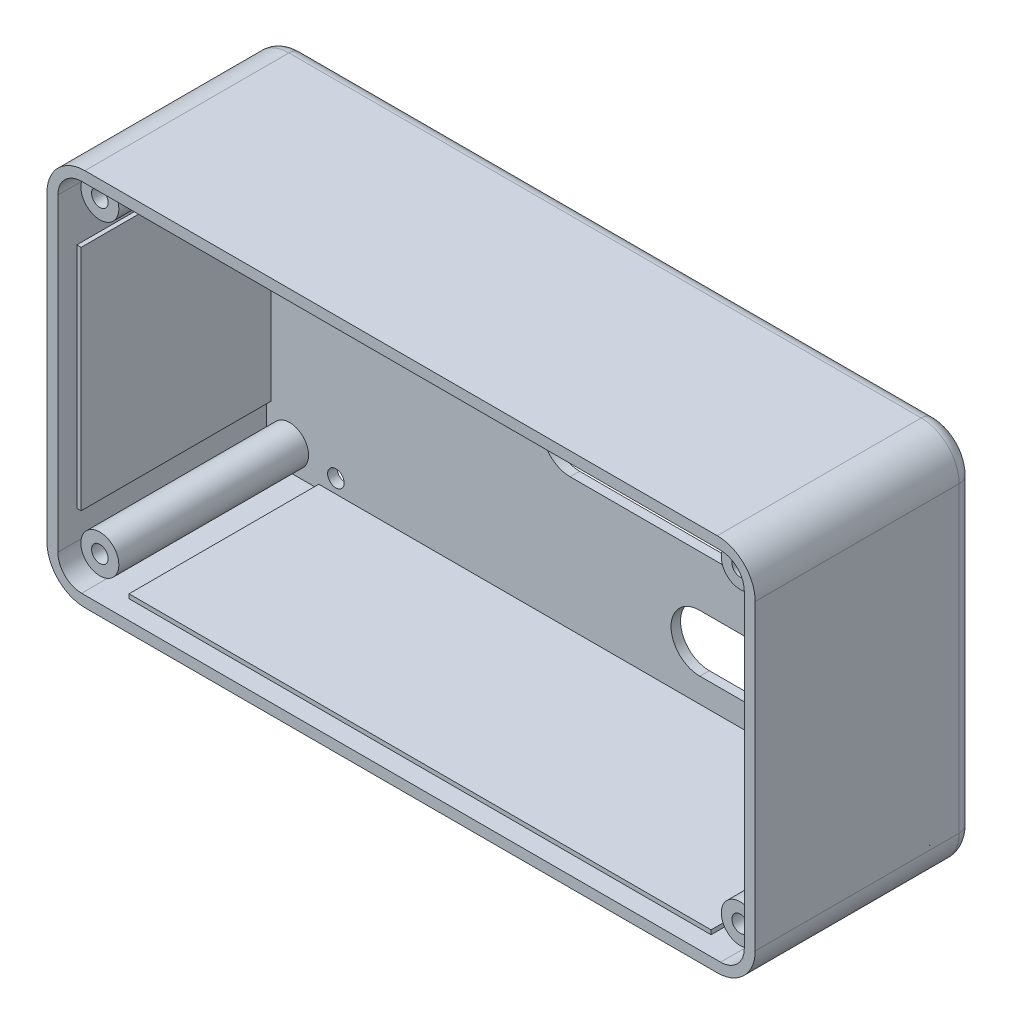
ISO-10303-21;
HEADER;
FILE_DESCRIPTION(('STEP AP214'),'2;1');
FILE_NAME('part.step','',(''),(''),'','','');
FILE_SCHEMA(('AUTOMOTIVE_DESIGN { 1 0 10303 214 1 1 1 1 }'));
ENDSEC;
DATA;
#1=APPLICATION_CONTEXT('core data for automotive mechanical design processes');
#2=APPLICATION_PROTOCOL_DEFINITION('international standard','automotive_design',2000,#1);
#3=PRODUCT_CONTEXT('',#1,'mechanical');
#4=PRODUCT('Part','Part','',(#3));
#5=PRODUCT_RELATED_PRODUCT_CATEGORY('part','',(#4));
#6=PRODUCT_DEFINITION_FORMATION('','',#4);
#7=PRODUCT_DEFINITION_CONTEXT('part definition',#1,'design');
#8=PRODUCT_DEFINITION('design','',#6,#7);
#9=PRODUCT_DEFINITION_SHAPE('','',#8);
#10=(LENGTH_UNIT() NAMED_UNIT(*) SI_UNIT(.MILLI.,.METRE.));
#11=(NAMED_UNIT(*) PLANE_ANGLE_UNIT() SI_UNIT($,.RADIAN.));
#12=(NAMED_UNIT(*) SI_UNIT($,.STERADIAN.) SOLID_ANGLE_UNIT());
#13=UNCERTAINTY_MEASURE_WITH_UNIT(LENGTH_MEASURE(1.E-05),#10,'distance_accuracy_value','');
#14=(GEOMETRIC_REPRESENTATION_CONTEXT(3) GLOBAL_UNCERTAINTY_ASSIGNED_CONTEXT((#13)) GLOBAL_UNIT_ASSIGNED_CONTEXT((#10,
#11,#12)) REPRESENTATION_CONTEXT('',''));
#15=CARTESIAN_POINT('',(0.,0.,0.));
#16=DIRECTION('',(0.,0.,1.));
#17=DIRECTION('',(1.,0.,0.));
#18=AXIS2_PLACEMENT_3D('',#15,#16,#17);
#19=CARTESIAN_POINT('',(-67.3500000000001,32.6,1.99999999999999));
#20=DIRECTION('',(0.,0.,-1.));
#21=DIRECTION('',(-1.,0.,0.));
#22=AXIS2_PLACEMENT_3D('',#19,#20,#21);
#23=PLANE('',#22);
#24=CARTESIAN_POINT('',(59.79,-34.63,1.99999999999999));
#25=DIRECTION('',(0.,0.,-1.));
#26=DIRECTION('',(-1.,0.,0.));
#27=AXIS2_PLACEMENT_3D('',#24,#25,#26);
#28=CIRCLE('',#27,1.75);
#29=CARTESIAN_POINT('',(58.04,-34.63,1.99999999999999));
#30=VERTEX_POINT('',#29);
#31=EDGE_CURVE('E1272',#30,#30,#28,.T.);
#32=ORIENTED_EDGE('',*,*,#31,.T.);
#33=EDGE_LOOP('',(#32));
#34=FACE_BOUND('',#33,.T.);
#35=CARTESIAN_POINT('',(-57.74,-33.8200000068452,1.99999999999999));
#36=DIRECTION('',(0.,0.,-1.));
#37=DIRECTION('',(-1.,0.,0.));
#38=AXIS2_PLACEMENT_3D('',#35,#36,#37);
#39=CIRCLE('',#38,1.75);
#40=CARTESIAN_POINT('',(-59.49,-33.8200000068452,1.99999999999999));
#41=VERTEX_POINT('',#40);
#42=EDGE_CURVE('E1276',#41,#41,#39,.T.);
#43=ORIENTED_EDGE('',*,*,#42,.T.);
#44=EDGE_LOOP('',(#43));
#45=FACE_BOUND('',#44,.T.);
#46=CARTESIAN_POINT('',(-57.74,31.9499999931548,1.99999999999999));
#47=DIRECTION('',(0.,0.,-1.));
#48=DIRECTION('',(-1.,0.,0.));
#49=AXIS2_PLACEMENT_3D('',#46,#47,#48);
#50=CIRCLE('',#49,1.75);
#51=CARTESIAN_POINT('',(-59.49,31.9499999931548,1.99999999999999));
#52=VERTEX_POINT('',#51);
#53=EDGE_CURVE('E1285',#52,#52,#50,.T.);
#54=ORIENTED_EDGE('',*,*,#53,.T.);
#55=EDGE_LOOP('',(#54));
#56=FACE_BOUND('',#55,.T.);
#57=CARTESIAN_POINT('',(59.65,32.9,1.99999999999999));
#58=DIRECTION('',(0.,0.,-1.));
#59=DIRECTION('',(-1.,0.,0.));
#60=AXIS2_PLACEMENT_3D('',#57,#58,#59);
#61=CIRCLE('',#60,1.75000000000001);
#62=CARTESIAN_POINT('',(57.9,32.9,1.99999999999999));
#63=VERTEX_POINT('',#62);
#64=EDGE_CURVE('E1291',#63,#63,#61,.T.);
#65=ORIENTED_EDGE('',*,*,#64,.T.);
#66=EDGE_LOOP('',(#65));
#67=FACE_BOUND('',#66,.T.);
#68=DIRECTION('',(1.,0.,0.));
#69=VECTOR('',#68,1.);
#70=CARTESIAN_POINT('',(-67.3500000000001,-19.5705032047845,1.99999999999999));
#71=LINE('',#70,#69);
#72=CARTESIAN_POINT('',(18.8322977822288,-19.5705032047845,1.99999999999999));
#73=VERTEX_POINT('',#72);
#74=CARTESIAN_POINT('',(46.832297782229,-19.5705032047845,1.99999999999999));
#75=VERTEX_POINT('',#74);
#76=EDGE_CURVE('E390',#73,#75,#71,.T.);
#77=ORIENTED_EDGE('',*,*,#76,.T.);
#78=CARTESIAN_POINT('',(46.910003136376,-25.5700000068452,1.99999999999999));
#79=DIRECTION('',(0.,0.,-1.));
#80=DIRECTION('',(-1.,0.,0.));
#81=AXIS2_PLACEMENT_3D('',#78,#79,#80);
#82=CIRCLE('',#81,6.);
#83=CARTESIAN_POINT('',(46.8322977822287,-31.5694968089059,1.99999999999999));
#84=VERTEX_POINT('',#83);
#85=EDGE_CURVE('E393',#75,#84,#82,.T.);
#86=ORIENTED_EDGE('',*,*,#85,.T.);
#87=DIRECTION('',(-1.,0.,0.));
#88=VECTOR('',#87,1.);
#89=CARTESIAN_POINT('',(-67.3500000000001,-31.5694968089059,1.99999999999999));
#90=LINE('',#89,#88);
#91=CARTESIAN_POINT('',(18.9877084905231,-31.5694968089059,1.99999999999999));
#92=VERTEX_POINT('',#91);
#93=EDGE_CURVE('E385',#84,#92,#90,.T.);
#94=ORIENTED_EDGE('',*,*,#93,.T.);
#95=CARTESIAN_POINT('',(18.910003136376,-25.5700000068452,1.99999999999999));
#96=DIRECTION('',(0.,0.,-1.));
#97=DIRECTION('',(-1.,0.,0.));
#98=AXIS2_PLACEMENT_3D('',#95,#96,#97);
#99=CIRCLE('',#98,6.);
#100=EDGE_CURVE('E365',#92,#73,#99,.T.);
#101=ORIENTED_EDGE('',*,*,#100,.T.);
#102=EDGE_LOOP('',(#77,#86,#94,#101));
#103=FACE_BOUND('',#102,.T.);
#104=DIRECTION('',(1.,0.,0.));
#105=VECTOR('',#104,1.);
#106=CARTESIAN_POINT('',(-67.3500000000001,3.15998570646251,1.99999999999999));
#107=LINE('',#106,#105);
#108=CARTESIAN_POINT('',(-8.33396066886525,3.15998570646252,1.99999999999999));
#109=VERTEX_POINT('',#108);
#110=CARTESIAN_POINT('',(32.66309665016,3.15998570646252,1.99999999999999));
#111=VERTEX_POINT('',#110);
#112=EDGE_CURVE('E422',#109,#111,#107,.T.);
#113=ORIENTED_EDGE('',*,*,#112,.T.);
#114=CARTESIAN_POINT('',(32.650003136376,-2.8400000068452,1.99999999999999));
#115=DIRECTION('',(0.,0.,-1.));
#116=DIRECTION('',(-1.,0.,0.));
#117=AXIS2_PLACEMENT_3D('',#114,#115,#116);
#118=CIRCLE('',#117,6.);
#119=CARTESIAN_POINT('',(32.636909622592,-8.83998572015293,1.99999999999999));
#120=VERTEX_POINT('',#119);
#121=EDGE_CURVE('E425',#111,#120,#118,.T.);
#122=ORIENTED_EDGE('',*,*,#121,.T.);
#123=DIRECTION('',(-1.,0.,0.));
#124=VECTOR('',#123,1.);
#125=CARTESIAN_POINT('',(-67.3500000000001,-8.83998572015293,1.99999999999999));
#126=LINE('',#125,#124);
#127=CARTESIAN_POINT('',(-8.3592554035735,-8.83998572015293,1.99999999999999));
#128=VERTEX_POINT('',#127);
#129=EDGE_CURVE('E410',#120,#128,#126,.T.);
#130=ORIENTED_EDGE('',*,*,#129,.T.);
#131=CARTESIAN_POINT('',(-8.34999686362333,-2.83999286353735,1.99999999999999));
#132=DIRECTION('',(0.,0.,-1.));
#133=DIRECTION('',(-1.,0.,0.));
#134=AXIS2_PLACEMENT_3D('',#131,#132,#133);
#135=CIRCLE('',#134,6.);
#136=EDGE_CURVE('E419',#128,#109,#135,.T.);
#137=ORIENTED_EDGE('',*,*,#136,.T.);
#138=EDGE_LOOP('',(#113,#122,#130,#137));
#139=FACE_BOUND('',#138,.T.);
#140=DIRECTION('',(1.,0.,0.));
#141=VECTOR('',#140,1.);
#142=CARTESIAN_POINT('',(-67.3500000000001,29.9299856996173,1.99999999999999));
#143=LINE('',#142,#141);
#144=CARTESIAN_POINT('',(-4.66395735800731,29.9299856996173,1.99999999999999));
#145=VERTEX_POINT('',#144);
#146=CARTESIAN_POINT('',(36.333099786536,29.9299856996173,1.99999999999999));
#147=VERTEX_POINT('',#146);
#148=EDGE_CURVE('E454',#145,#147,#143,.T.);
#149=ORIENTED_EDGE('',*,*,#148,.T.);
#150=CARTESIAN_POINT('',(36.320003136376,23.9299999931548,1.99999999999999));
#151=DIRECTION('',(0.,0.,-1.));
#152=DIRECTION('',(-1.,0.,0.));
#153=AXIS2_PLACEMENT_3D('',#150,#151,#152);
#154=CIRCLE('',#153,6.);
#155=CARTESIAN_POINT('',(36.306906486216,17.9300142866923,1.99999999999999));
#156=VERTEX_POINT('',#155);
#157=EDGE_CURVE('E457',#147,#156,#154,.T.);
#158=ORIENTED_EDGE('',*,*,#157,.T.);
#159=DIRECTION('',(-1.,0.,0.));
#160=VECTOR('',#159,1.);
#161=CARTESIAN_POINT('',(-67.3500000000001,17.9300142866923,1.99999999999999));
#162=LINE('',#161,#160);
#163=CARTESIAN_POINT('',(-4.68925853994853,17.9300142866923,1.99999999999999));
#164=VERTEX_POINT('',#163);
#165=EDGE_CURVE('E442',#156,#164,#162,.T.);
#166=ORIENTED_EDGE('',*,*,#165,.T.);
#167=CARTESIAN_POINT('',(-4.67999686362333,23.9300071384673,1.99999999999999));
#168=DIRECTION('',(0.,0.,-1.));
#169=DIRECTION('',(-1.,0.,0.));
#170=AXIS2_PLACEMENT_3D('',#167,#168,#169);
#171=CIRCLE('',#170,6.);
#172=EDGE_CURVE('E451',#164,#145,#171,.T.);
#173=ORIENTED_EDGE('',*,*,#172,.T.);
#174=EDGE_LOOP('',(#149,#158,#166,#173));
#175=FACE_BOUND('',#174,.T.);
#176=CARTESIAN_POINT('',(-29.9799968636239,27.8699999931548,1.99999999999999));
#177=DIRECTION('',(0.,0.,-1.));
#178=DIRECTION('',(-1.,0.,0.));
#179=AXIS2_PLACEMENT_3D('',#176,#177,#178);
#180=CIRCLE('',#179,6.);
#181=CARTESIAN_POINT('',(-29.9525065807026,33.8699370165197,1.99999999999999));
#182=VERTEX_POINT('',#181);
#183=CARTESIAN_POINT('',(-30.0074871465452,21.8700629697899,1.99999999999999));
#184=VERTEX_POINT('',#183);
#185=EDGE_CURVE('E858',#182,#184,#180,.T.);
#186=ORIENTED_EDGE('',*,*,#185,.T.);
#187=DIRECTION('',(-1.,0.,0.));
#188=VECTOR('',#187,1.);
#189=CARTESIAN_POINT('',(-67.3500000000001,21.8700629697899,1.99999999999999));
#190=LINE('',#189,#188);
#191=CARTESIAN_POINT('',(-49.0071565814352,21.8700629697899,1.99999999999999));
#192=VERTEX_POINT('',#191);
#193=EDGE_CURVE('E11',#184,#192,#190,.T.);
#194=ORIENTED_EDGE('',*,*,#193,.T.);
#195=CARTESIAN_POINT('',(-48.9799968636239,27.870001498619,1.99999999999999));
#196=DIRECTION('',(0.,0.,-1.));
#197=DIRECTION('',(-1.,0.,0.));
#198=AXIS2_PLACEMENT_3D('',#195,#196,#197);
#199=CIRCLE('',#198,6.);
#200=CARTESIAN_POINT('',(-48.9521799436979,33.8699370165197,1.99999999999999));
#201=VERTEX_POINT('',#200);
#202=EDGE_CURVE('E38',#192,#201,#199,.T.);
#203=ORIENTED_EDGE('',*,*,#202,.T.);
#204=DIRECTION('',(1.,0.,0.));
#205=VECTOR('',#204,1.);
#206=CARTESIAN_POINT('',(-67.3500000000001,33.8699370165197,1.99999999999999));
#207=LINE('',#206,#205);
#208=EDGE_CURVE('E855',#201,#182,#207,.T.);
#209=ORIENTED_EDGE('',*,*,#208,.T.);
#210=EDGE_LOOP('',(#186,#194,#203,#209));
#211=FACE_BOUND('',#210,.T.);
#212=CARTESIAN_POINT('',(67.5,-32.5,1.99999999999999));
#213=DIRECTION('',(0.,0.,-1.));
#214=DIRECTION('',(-1.,0.,0.));
#215=AXIS2_PLACEMENT_3D('',#212,#213,#214);
#216=CIRCLE('',#215,4.00000000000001);
#217=CARTESIAN_POINT('',(63.5,-32.5,1.99999999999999));
#218=VERTEX_POINT('',#217);
#219=EDGE_CURVE('E846',#218,#218,#216,.F.);
#220=ORIENTED_EDGE('',*,*,#219,.F.);
#221=EDGE_LOOP('',(#220));
#222=FACE_BOUND('',#221,.T.);
#223=CARTESIAN_POINT('',(-67.5,32.5,1.99999999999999));
#224=DIRECTION('',(0.,0.,-1.));
#225=DIRECTION('',(-1.,0.,0.));
#226=AXIS2_PLACEMENT_3D('',#223,#224,#225);
#227=CIRCLE('',#226,4.00000000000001);
#228=CARTESIAN_POINT('',(-71.5,32.5,1.99999999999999));
#229=VERTEX_POINT('',#228);
#230=EDGE_CURVE('E583',#229,#229,#227,.F.);
#231=ORIENTED_EDGE('',*,*,#230,.F.);
#232=EDGE_LOOP('',(#231));
#233=FACE_BOUND('',#232,.T.);
#234=DIRECTION('',(-1.,0.,0.));
#235=VECTOR('',#234,1.);
#236=CARTESIAN_POINT('',(-61.35,37.6,1.99999999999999));
#237=LINE('',#236,#235);
#238=CARTESIAN_POINT('',(-61.35,37.6,1.99999999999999));
#239=VERTEX_POINT('',#238);
#240=CARTESIAN_POINT('',(-67.35,37.6,1.99999999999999));
#241=VERTEX_POINT('',#240);
#242=EDGE_CURVE('E589',#239,#241,#237,.T.);
#243=ORIENTED_EDGE('',*,*,#242,.T.);
#244=CARTESIAN_POINT('',(-67.3500000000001,32.6,1.99999999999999));
#245=DIRECTION('',(0.,0.,1.));
#246=DIRECTION('',(-1.,0.,0.));
#247=AXIS2_PLACEMENT_3D('',#244,#245,#246);
#248=CIRCLE('',#247,5.);
#249=CARTESIAN_POINT('',(-72.3500000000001,32.5999999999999,1.99999999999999));
#250=VERTEX_POINT('',#249);
#251=EDGE_CURVE('E592',#241,#250,#248,.T.);
#252=ORIENTED_EDGE('',*,*,#251,.T.);
#253=DIRECTION('',(0.,-1.,0.));
#254=VECTOR('',#253,1.);
#255=CARTESIAN_POINT('',(-72.35,21.5,1.99999999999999));
#256=LINE('',#255,#254);
#257=CARTESIAN_POINT('',(-72.35,21.5,1.99999999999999));
#258=VERTEX_POINT('',#257);
#259=EDGE_CURVE('E595',#250,#258,#256,.T.);
#260=ORIENTED_EDGE('',*,*,#259,.T.);
#261=DIRECTION('',(1.,0.,0.));
#262=VECTOR('',#261,1.);
#263=CARTESIAN_POINT('',(-71.45,21.5,1.99999999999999));
#264=LINE('',#263,#262);
#265=CARTESIAN_POINT('',(-71.45,21.5,1.99999999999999));
#266=VERTEX_POINT('',#265);
#267=EDGE_CURVE('E598',#258,#266,#264,.T.);
#268=ORIENTED_EDGE('',*,*,#267,.T.);
#269=DIRECTION('',(0.,-1.,0.));
#270=VECTOR('',#269,1.);
#271=CARTESIAN_POINT('',(-71.45,-26.6,1.99999999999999));
#272=LINE('',#271,#270);
#273=CARTESIAN_POINT('',(-71.45,-26.6,1.99999999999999));
#274=VERTEX_POINT('',#273);
#275=EDGE_CURVE('E601',#266,#274,#272,.T.);
#276=ORIENTED_EDGE('',*,*,#275,.T.);
#277=DIRECTION('',(-1.,0.,0.));
#278=VECTOR('',#277,1.);
#279=CARTESIAN_POINT('',(-72.35,-26.6,1.99999999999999));
#280=LINE('',#279,#278);
#281=CARTESIAN_POINT('',(-72.35,-26.6,1.99999999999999));
#282=VERTEX_POINT('',#281);
#283=EDGE_CURVE('E604',#274,#282,#280,.T.);
#284=ORIENTED_EDGE('',*,*,#283,.T.);
#285=DIRECTION('',(0.,-1.,0.));
#286=VECTOR('',#285,1.);
#287=CARTESIAN_POINT('',(-72.35,-26.6,1.99999999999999));
#288=LINE('',#287,#286);
#289=CARTESIAN_POINT('',(-72.35,-32.6,1.99999999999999));
#290=VERTEX_POINT('',#289);
#291=EDGE_CURVE('E607',#282,#290,#288,.T.);
#292=ORIENTED_EDGE('',*,*,#291,.T.);
#293=CARTESIAN_POINT('',(-67.35,-32.6,1.99999999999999));
#294=DIRECTION('',(0.,0.,1.));
#295=DIRECTION('',(-1.,0.,0.));
#296=AXIS2_PLACEMENT_3D('',#293,#294,#295);
#297=CIRCLE('',#296,5.);
#298=CARTESIAN_POINT('',(-67.35,-37.6,1.99999999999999));
#299=VERTEX_POINT('',#298);
#300=EDGE_CURVE('E610',#290,#299,#297,.T.);
#301=ORIENTED_EDGE('',*,*,#300,.T.);
#302=DIRECTION('',(1.,0.,0.));
#303=VECTOR('',#302,1.);
#304=CARTESIAN_POINT('',(-61.35,-37.6,1.99999999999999));
#305=LINE('',#304,#303);
#306=CARTESIAN_POINT('',(-61.35,-37.6,1.99999999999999));
#307=VERTEX_POINT('',#306);
#308=EDGE_CURVE('E613',#299,#307,#305,.T.);
#309=ORIENTED_EDGE('',*,*,#308,.T.);
#310=DIRECTION('',(0.,1.,0.));
#311=VECTOR('',#310,1.);
#312=CARTESIAN_POINT('',(-61.35,-36.7,1.99999999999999));
#313=LINE('',#312,#311);
#314=CARTESIAN_POINT('',(-61.35,-36.7,1.99999999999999));
#315=VERTEX_POINT('',#314);
#316=EDGE_CURVE('E616',#307,#315,#313,.T.);
#317=ORIENTED_EDGE('',*,*,#316,.T.);
#318=DIRECTION('',(1.,0.,0.));
#319=VECTOR('',#318,1.);
#320=CARTESIAN_POINT('',(61.35,-36.7,1.99999999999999));
#321=LINE('',#320,#319);
#322=CARTESIAN_POINT('',(61.35,-36.7,1.99999999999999));
#323=VERTEX_POINT('',#322);
#324=EDGE_CURVE('E619',#315,#323,#321,.T.);
#325=ORIENTED_EDGE('',*,*,#324,.T.);
#326=DIRECTION('',(0.,-1.,0.));
#327=VECTOR('',#326,1.);
#328=CARTESIAN_POINT('',(61.35,-37.6,1.99999999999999));
#329=LINE('',#328,#327);
#330=CARTESIAN_POINT('',(61.35,-37.6,1.99999999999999));
#331=VERTEX_POINT('',#330);
#332=EDGE_CURVE('E622',#323,#331,#329,.T.);
#333=ORIENTED_EDGE('',*,*,#332,.T.);
#334=DIRECTION('',(1.,0.,0.));
#335=VECTOR('',#334,1.);
#336=CARTESIAN_POINT('',(61.35,-37.6,1.99999999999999));
#337=LINE('',#336,#335);
#338=CARTESIAN_POINT('',(67.3500000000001,-37.6,1.99999999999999));
#339=VERTEX_POINT('',#338);
#340=EDGE_CURVE('E625',#331,#339,#337,.T.);
#341=ORIENTED_EDGE('',*,*,#340,.T.);
#342=CARTESIAN_POINT('',(67.3500000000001,-32.6,1.99999999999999));
#343=DIRECTION('',(0.,0.,1.));
#344=DIRECTION('',(-1.,0.,0.));
#345=AXIS2_PLACEMENT_3D('',#342,#343,#344);
#346=CIRCLE('',#345,5.);
#347=CARTESIAN_POINT('',(72.3500000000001,-32.5999999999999,1.99999999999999));
#348=VERTEX_POINT('',#347);
#349=EDGE_CURVE('E628',#339,#348,#346,.T.);
#350=ORIENTED_EDGE('',*,*,#349,.T.);
#351=DIRECTION('',(0.,1.,0.));
#352=VECTOR('',#351,1.);
#353=CARTESIAN_POINT('',(72.3500000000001,-26.6,1.99999999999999));
#354=LINE('',#353,#352);
#355=CARTESIAN_POINT('',(72.3500000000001,-26.6,1.99999999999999));
#356=VERTEX_POINT('',#355);
#357=EDGE_CURVE('E631',#348,#356,#354,.T.);
#358=ORIENTED_EDGE('',*,*,#357,.T.);
#359=DIRECTION('',(-1.,0.,0.));
#360=VECTOR('',#359,1.);
#361=CARTESIAN_POINT('',(71.45,-26.6,1.99999999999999));
#362=LINE('',#361,#360);
#363=CARTESIAN_POINT('',(71.45,-26.6,1.99999999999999));
#364=VERTEX_POINT('',#363);
#365=EDGE_CURVE('E634',#356,#364,#362,.T.);
#366=ORIENTED_EDGE('',*,*,#365,.T.);
#367=DIRECTION('',(0.,1.,0.));
#368=VECTOR('',#367,1.);
#369=CARTESIAN_POINT('',(71.45,21.5,1.99999999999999));
#370=LINE('',#369,#368);
#371=CARTESIAN_POINT('',(71.45,21.5,1.99999999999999));
#372=VERTEX_POINT('',#371);
#373=EDGE_CURVE('E637',#364,#372,#370,.T.);
#374=ORIENTED_EDGE('',*,*,#373,.T.);
#375=DIRECTION('',(1.,0.,0.));
#376=VECTOR('',#375,1.);
#377=CARTESIAN_POINT('',(72.35,21.5,1.99999999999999));
#378=LINE('',#377,#376);
#379=CARTESIAN_POINT('',(72.35,21.5,1.99999999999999));
#380=VERTEX_POINT('',#379);
#381=EDGE_CURVE('E640',#372,#380,#378,.T.);
#382=ORIENTED_EDGE('',*,*,#381,.T.);
#383=DIRECTION('',(0.,1.,0.));
#384=VECTOR('',#383,1.);
#385=CARTESIAN_POINT('',(72.35,21.5,1.99999999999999));
#386=LINE('',#385,#384);
#387=CARTESIAN_POINT('',(72.35,32.6,1.99999999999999));
#388=VERTEX_POINT('',#387);
#389=EDGE_CURVE('E643',#380,#388,#386,.T.);
#390=ORIENTED_EDGE('',*,*,#389,.T.);
#391=CARTESIAN_POINT('',(67.35,32.6,1.99999999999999));
#392=DIRECTION('',(0.,0.,1.));
#393=DIRECTION('',(-1.,0.,0.));
#394=AXIS2_PLACEMENT_3D('',#391,#392,#393);
#395=CIRCLE('',#394,5.);
#396=CARTESIAN_POINT('',(67.35,37.6,1.99999999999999));
#397=VERTEX_POINT('',#396);
#398=EDGE_CURVE('E646',#388,#397,#395,.T.);
#399=ORIENTED_EDGE('',*,*,#398,.T.);
#400=DIRECTION('',(-1.,0.,0.));
#401=VECTOR('',#400,1.);
#402=CARTESIAN_POINT('',(61.35,37.6,1.99999999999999));
#403=LINE('',#402,#401);
#404=CARTESIAN_POINT('',(61.35,37.6,1.99999999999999));
#405=VERTEX_POINT('',#404);
#406=EDGE_CURVE('E649',#397,#405,#403,.T.);
#407=ORIENTED_EDGE('',*,*,#406,.T.);
#408=DIRECTION('',(0.,-1.,0.));
#409=VECTOR('',#408,1.);
#410=CARTESIAN_POINT('',(61.35,36.7,1.99999999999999));
#411=LINE('',#410,#409);
#412=CARTESIAN_POINT('',(61.35,36.7,1.99999999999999));
#413=VERTEX_POINT('',#412);
#414=EDGE_CURVE('E652',#405,#413,#411,.T.);
#415=ORIENTED_EDGE('',*,*,#414,.T.);
#416=DIRECTION('',(-1.,0.,0.));
#417=VECTOR('',#416,1.);
#418=CARTESIAN_POINT('',(-61.35,36.7,1.99999999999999));
#419=LINE('',#418,#417);
#420=CARTESIAN_POINT('',(-61.35,36.7,1.99999999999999));
#421=VERTEX_POINT('',#420);
#422=EDGE_CURVE('E655',#413,#421,#419,.T.);
#423=ORIENTED_EDGE('',*,*,#422,.T.);
#424=DIRECTION('',(0.,1.,0.));
#425=VECTOR('',#424,1.);
#426=CARTESIAN_POINT('',(-61.35,37.6,1.99999999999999));
#427=LINE('',#426,#425);
#428=EDGE_CURVE('E658',#421,#239,#427,.T.);
#429=ORIENTED_EDGE('',*,*,#428,.T.);
#430=EDGE_LOOP('',(#243,#252,#260,#268,#276,#284,#292,#301,#309,#317,#325,#333,#341,#350,#358,
#366,#374,#382,#390,#399,#407,#415,#423,#429));
#431=FACE_BOUND('',#430,.T.);
#432=CARTESIAN_POINT('',(-67.5,-32.5,1.99999999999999));
#433=DIRECTION('',(0.,0.,-1.));
#434=DIRECTION('',(-1.,0.,0.));
#435=AXIS2_PLACEMENT_3D('',#432,#433,#434);
#436=CIRCLE('',#435,4.00000000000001);
#437=CARTESIAN_POINT('',(-71.5,-32.5,1.99999999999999));
#438=VERTEX_POINT('',#437);
#439=EDGE_CURVE('E842',#438,#438,#436,.F.);
#440=ORIENTED_EDGE('',*,*,#439,.F.);
#441=EDGE_LOOP('',(#440));
#442=FACE_BOUND('',#441,.T.);
#443=CARTESIAN_POINT('',(67.5,32.5,1.99999999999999));
#444=DIRECTION('',(0.,0.,-1.));
#445=DIRECTION('',(-1.,0.,0.));
#446=AXIS2_PLACEMENT_3D('',#443,#444,#445);
#447=CIRCLE('',#446,4.00000000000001);
#448=CARTESIAN_POINT('',(63.5,32.5,1.99999999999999));
#449=VERTEX_POINT('',#448);
#450=EDGE_CURVE('E850',#449,#449,#447,.F.);
#451=ORIENTED_EDGE('',*,*,#450,.F.);
#452=EDGE_LOOP('',(#451));
#453=FACE_BOUND('',#452,.T.);
#454=ADVANCED_FACE('F30',(#34,#45,#56,#67,#103,#139,#175,#211,#222,#233,#431,#442,#453),#23,.F.);
#455=CARTESIAN_POINT('',(-67.35,32.6,42.));
#456=DIRECTION('',(0.,0.,-1.));
#457=DIRECTION('',(-1.,0.,0.));
#458=AXIS2_PLACEMENT_3D('',#455,#456,#457);
#459=PLANE('',#458);
#460=DIRECTION('',(1.,0.,0.));
#461=VECTOR('',#460,1.);
#462=CARTESIAN_POINT('',(-71.45,21.5,42.));
#463=LINE('',#462,#461);
#464=CARTESIAN_POINT('',(-72.35,21.5,42.));
#465=VERTEX_POINT('',#464);
#466=CARTESIAN_POINT('',(-71.45,21.5,42.));
#467=VERTEX_POINT('',#466);
#468=EDGE_CURVE('E516',#465,#467,#463,.T.);
#469=ORIENTED_EDGE('',*,*,#468,.F.);
#470=DIRECTION('',(0.,-1.,0.));
#471=VECTOR('',#470,1.);
#472=CARTESIAN_POINT('',(-72.35,32.6,42.));
#473=LINE('',#472,#471);
#474=CARTESIAN_POINT('',(-72.35,-26.6,42.));
#475=VERTEX_POINT('',#474);
#476=EDGE_CURVE('E700',#465,#475,#473,.T.);
#477=ORIENTED_EDGE('',*,*,#476,.T.);
#478=DIRECTION('',(-1.,0.,0.));
#479=VECTOR('',#478,1.);
#480=CARTESIAN_POINT('',(-72.35,-26.6,42.));
#481=LINE('',#480,#479);
#482=CARTESIAN_POINT('',(-71.45,-26.6,42.));
#483=VERTEX_POINT('',#482);
#484=EDGE_CURVE('E533',#483,#475,#481,.T.);
#485=ORIENTED_EDGE('',*,*,#484,.F.);
#486=DIRECTION('',(0.,-1.,0.));
#487=VECTOR('',#486,1.);
#488=CARTESIAN_POINT('',(-71.45,-26.6,42.));
#489=LINE('',#488,#487);
#490=EDGE_CURVE('E519',#467,#483,#489,.T.);
#491=ORIENTED_EDGE('',*,*,#490,.F.);
#492=EDGE_LOOP('',(#469,#477,#485,#491));
#493=FACE_BOUND('',#492,.T.);
#494=ADVANCED_FACE('F891',(#493),#459,.F.);
#495=DIRECTION('',(0.,1.,0.));
#496=VECTOR('',#495,1.);
#497=CARTESIAN_POINT('',(-61.35,-36.7,42.));
#498=LINE('',#497,#496);
#499=CARTESIAN_POINT('',(-61.35,-37.6,42.));
#500=VERTEX_POINT('',#499);
#501=CARTESIAN_POINT('',(-61.35,-36.7,42.));
#502=VERTEX_POINT('',#501);
#503=EDGE_CURVE('E536',#500,#502,#498,.T.);
#504=ORIENTED_EDGE('',*,*,#503,.F.);
#505=DIRECTION('',(1.,0.,0.));
#506=VECTOR('',#505,1.);
#507=CARTESIAN_POINT('',(-67.35,-37.6,42.));
#508=LINE('',#507,#506);
#509=CARTESIAN_POINT('',(61.35,-37.6,42.));
#510=VERTEX_POINT('',#509);
#511=EDGE_CURVE('E709',#500,#510,#508,.T.);
#512=ORIENTED_EDGE('',*,*,#511,.T.);
#513=DIRECTION('',(0.,-1.,0.));
#514=VECTOR('',#513,1.);
#515=CARTESIAN_POINT('',(61.35,-37.6,42.));
#516=LINE('',#515,#514);
#517=CARTESIAN_POINT('',(61.35,-36.7,42.));
#518=VERTEX_POINT('',#517);
#519=EDGE_CURVE('E552',#518,#510,#516,.T.);
#520=ORIENTED_EDGE('',*,*,#519,.F.);
#521=DIRECTION('',(1.,0.,0.));
#522=VECTOR('',#521,1.);
#523=CARTESIAN_POINT('',(61.35,-36.7,42.));
#524=LINE('',#523,#522);
#525=EDGE_CURVE('E545',#502,#518,#524,.T.);
#526=ORIENTED_EDGE('',*,*,#525,.F.);
#527=EDGE_LOOP('',(#504,#512,#520,#526));
#528=FACE_BOUND('',#527,.T.);
#529=ADVANCED_FACE('F899',(#528),#459,.F.);
#530=DIRECTION('',(-1.,0.,0.));
#531=VECTOR('',#530,1.);
#532=CARTESIAN_POINT('',(71.45,-26.6,42.));
#533=LINE('',#532,#531);
#534=CARTESIAN_POINT('',(72.3500000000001,-26.6,42.));
#535=VERTEX_POINT('',#534);
#536=CARTESIAN_POINT('',(71.45,-26.6,42.));
#537=VERTEX_POINT('',#536);
#538=EDGE_CURVE('E558',#535,#537,#533,.T.);
#539=ORIENTED_EDGE('',*,*,#538,.F.);
#540=DIRECTION('',(0.,1.,0.));
#541=VECTOR('',#540,1.);
#542=CARTESIAN_POINT('',(72.35,32.6,42.));
#543=LINE('',#542,#541);
#544=CARTESIAN_POINT('',(72.35,21.5,42.));
#545=VERTEX_POINT('',#544);
#546=EDGE_CURVE('E714',#535,#545,#543,.T.);
#547=ORIENTED_EDGE('',*,*,#546,.T.);
#548=DIRECTION('',(1.,0.,0.));
#549=VECTOR('',#548,1.);
#550=CARTESIAN_POINT('',(72.35,21.5,42.));
#551=LINE('',#550,#549);
#552=CARTESIAN_POINT('',(71.45,21.5,42.));
#553=VERTEX_POINT('',#552);
#554=EDGE_CURVE('E570',#553,#545,#551,.T.);
#555=ORIENTED_EDGE('',*,*,#554,.F.);
#556=DIRECTION('',(0.,1.,0.));
#557=VECTOR('',#556,1.);
#558=CARTESIAN_POINT('',(71.45,21.5,42.));
#559=LINE('',#558,#557);
#560=EDGE_CURVE('E555',#537,#553,#559,.T.);
#561=ORIENTED_EDGE('',*,*,#560,.F.);
#562=EDGE_LOOP('',(#539,#547,#555,#561));
#563=FACE_BOUND('',#562,.T.);
#564=ADVANCED_FACE('F1645',(#563),#459,.F.);
#565=DIRECTION('',(0.,-1.,0.));
#566=VECTOR('',#565,1.);
#567=CARTESIAN_POINT('',(61.35,36.7,42.));
#568=LINE('',#567,#566);
#569=CARTESIAN_POINT('',(61.35,37.6,42.));
#570=VERTEX_POINT('',#569);
#571=CARTESIAN_POINT('',(61.35,36.7,42.));
#572=VERTEX_POINT('',#571);
#573=EDGE_CURVE('E573',#570,#572,#568,.T.);
#574=ORIENTED_EDGE('',*,*,#573,.F.);
#575=DIRECTION('',(-1.,0.,0.));
#576=VECTOR('',#575,1.);
#577=CARTESIAN_POINT('',(-67.35,37.6,42.));
#578=LINE('',#577,#576);
#579=CARTESIAN_POINT('',(-61.35,37.6,42.));
#580=VERTEX_POINT('',#579);
#581=EDGE_CURVE('E717',#570,#580,#578,.T.);
#582=ORIENTED_EDGE('',*,*,#581,.T.);
#583=DIRECTION('',(0.,1.,0.));
#584=VECTOR('',#583,1.);
#585=CARTESIAN_POINT('',(-61.35,37.6,42.));
#586=LINE('',#585,#584);
#587=CARTESIAN_POINT('',(-61.35,36.7,42.));
#588=VERTEX_POINT('',#587);
#589=EDGE_CURVE('E588',#588,#580,#586,.T.);
#590=ORIENTED_EDGE('',*,*,#589,.F.);
#591=DIRECTION('',(-1.,0.,0.));
#592=VECTOR('',#591,1.);
#593=CARTESIAN_POINT('',(-61.35,36.7,42.));
#594=LINE('',#593,#592);
#595=EDGE_CURVE('E582',#572,#588,#594,.T.);
#596=ORIENTED_EDGE('',*,*,#595,.F.);
#597=EDGE_LOOP('',(#574,#582,#590,#596));
#598=FACE_BOUND('',#597,.T.);
#599=ADVANCED_FACE('F902',(#598),#459,.F.);
#600=CARTESIAN_POINT('',(-66.65,31.9,46.));
#601=DIRECTION('',(0.,0.,-1.));
#602=DIRECTION('',(-1.,0.,0.));
#603=AXIS2_PLACEMENT_3D('',#600,#601,#602);
#604=CYLINDRICAL_SURFACE('',#603,8.);
#605=DIRECTION('',(0.,0.,-1.));
#606=VECTOR('',#605,1.);
#607=CARTESIAN_POINT('',(-66.65,39.9,46.));
#608=LINE('',#607,#606);
#609=CARTESIAN_POINT('',(-66.65,39.9,46.));
#610=VERTEX_POINT('',#609);
#611=CARTESIAN_POINT('',(-66.65,39.9,3.));
#612=VERTEX_POINT('',#611);
#613=EDGE_CURVE('E780',#610,#612,#608,.T.);
#614=ORIENTED_EDGE('',*,*,#613,.T.);
#615=CARTESIAN_POINT('',(-66.65,31.9,3.));
#616=DIRECTION('',(0.,0.,-1.));
#617=DIRECTION('',(-1.,0.,0.));
#618=AXIS2_PLACEMENT_3D('',#615,#616,#617);
#619=CIRCLE('',#618,8.);
#620=CARTESIAN_POINT('',(-74.65,31.9,3.));
#621=VERTEX_POINT('',#620);
#622=EDGE_CURVE('E710',#612,#621,#619,.F.);
#623=ORIENTED_EDGE('',*,*,#622,.T.);
#624=DIRECTION('',(0.,0.,-1.));
#625=VECTOR('',#624,1.);
#626=CARTESIAN_POINT('',(-74.65,31.9,46.));
#627=LINE('',#626,#625);
#628=CARTESIAN_POINT('',(-74.65,31.9,46.));
#629=VERTEX_POINT('',#628);
#630=EDGE_CURVE('E794',#629,#621,#627,.T.);
#631=ORIENTED_EDGE('',*,*,#630,.F.);
#632=CARTESIAN_POINT('',(-66.65,31.9,46.));
#633=DIRECTION('',(0.,0.,1.));
#634=DIRECTION('',(-1.,0.,0.));
#635=AXIS2_PLACEMENT_3D('',#632,#633,#634);
#636=CIRCLE('',#635,8.);
#637=EDGE_CURVE('E763',#610,#629,#636,.T.);
#638=ORIENTED_EDGE('',*,*,#637,.F.);
#639=EDGE_LOOP('',(#614,#623,#631,#638));
#640=FACE_BOUND('',#639,.T.);
#641=ADVANCED_FACE('F32',(#640),#604,.T.);
#642=CARTESIAN_POINT('',(-74.65,31.9,46.));
#643=DIRECTION('',(1.,0.,0.));
#644=DIRECTION('',(0.,1.,0.));
#645=AXIS2_PLACEMENT_3D('',#642,#643,#644);
#646=PLANE('',#645);
#647=ORIENTED_EDGE('',*,*,#630,.T.);
#648=DIRECTION('',(0.,-1.,0.));
#649=VECTOR('',#648,1.);
#650=CARTESIAN_POINT('',(-74.65,-31.9,3.));
#651=LINE('',#650,#649);
#652=CARTESIAN_POINT('',(-74.65,-31.9,3.));
#653=VERTEX_POINT('',#652);
#654=EDGE_CURVE('E796',#621,#653,#651,.T.);
#655=ORIENTED_EDGE('',*,*,#654,.T.);
#656=DIRECTION('',(0.,0.,-1.));
#657=VECTOR('',#656,1.);
#658=CARTESIAN_POINT('',(-74.65,-31.9,46.));
#659=LINE('',#658,#657);
#660=CARTESIAN_POINT('',(-74.65,-31.9,46.));
#661=VERTEX_POINT('',#660);
#662=EDGE_CURVE('E792',#661,#653,#659,.T.);
#663=ORIENTED_EDGE('',*,*,#662,.F.);
#664=DIRECTION('',(0.,-1.,0.));
#665=VECTOR('',#664,1.);
#666=CARTESIAN_POINT('',(-74.65,31.9,46.));
#667=LINE('',#666,#665);
#668=EDGE_CURVE('E766',#629,#661,#667,.T.);
#669=ORIENTED_EDGE('',*,*,#668,.F.);
#670=EDGE_LOOP('',(#647,#655,#663,#669));
#671=FACE_BOUND('',#670,.T.);
#672=ADVANCED_FACE('F1666',(#671),#646,.F.);
#673=CARTESIAN_POINT('',(-66.65,-31.9,46.));
#674=DIRECTION('',(0.,0.,-1.));
#675=DIRECTION('',(-1.,0.,0.));
#676=AXIS2_PLACEMENT_3D('',#673,#674,#675);
#677=CYLINDRICAL_SURFACE('',#676,7.99999999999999);
#678=ORIENTED_EDGE('',*,*,#662,.T.);
#679=CARTESIAN_POINT('',(-66.65,-31.9,3.));
#680=DIRECTION('',(0.,0.,-1.));
#681=DIRECTION('',(-1.,0.,0.));
#682=AXIS2_PLACEMENT_3D('',#679,#680,#681);
#683=CIRCLE('',#682,7.99999999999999);
#684=CARTESIAN_POINT('',(-66.65,-39.9,3.));
#685=VERTEX_POINT('',#684);
#686=EDGE_CURVE('E816',#653,#685,#683,.F.);
#687=ORIENTED_EDGE('',*,*,#686,.T.);
#688=DIRECTION('',(0.,0.,-1.));
#689=VECTOR('',#688,1.);
#690=CARTESIAN_POINT('',(-66.65,-39.9,46.));
#691=LINE('',#690,#689);
#692=CARTESIAN_POINT('',(-66.65,-39.9,46.));
#693=VERTEX_POINT('',#692);
#694=EDGE_CURVE('E790',#693,#685,#691,.T.);
#695=ORIENTED_EDGE('',*,*,#694,.F.);
#696=CARTESIAN_POINT('',(-66.65,-31.9,46.));
#697=DIRECTION('',(0.,0.,1.));
#698=DIRECTION('',(-1.,0.,0.));
#699=AXIS2_PLACEMENT_3D('',#696,#697,#698);
#700=CIRCLE('',#699,7.99999999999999);
#701=EDGE_CURVE('E768',#661,#693,#700,.T.);
#702=ORIENTED_EDGE('',*,*,#701,.F.);
#703=EDGE_LOOP('',(#678,#687,#695,#702));
#704=FACE_BOUND('',#703,.T.);
#705=ADVANCED_FACE('F1674',(#704),#677,.T.);
#706=CARTESIAN_POINT('',(-66.65,-39.9,46.));
#707=DIRECTION('',(0.,1.,0.));
#708=DIRECTION('',(0.,0.,1.));
#709=AXIS2_PLACEMENT_3D('',#706,#707,#708);
#710=PLANE('',#709);
#711=ORIENTED_EDGE('',*,*,#694,.T.);
#712=DIRECTION('',(1.,0.,0.));
#713=VECTOR('',#712,1.);
#714=CARTESIAN_POINT('',(66.65,-39.9,3.));
#715=LINE('',#714,#713);
#716=CARTESIAN_POINT('',(66.65,-39.9,3.));
#717=VERTEX_POINT('',#716);
#718=EDGE_CURVE('E819',#685,#717,#715,.T.);
#719=ORIENTED_EDGE('',*,*,#718,.T.);
#720=DIRECTION('',(0.,0.,-1.));
#721=VECTOR('',#720,1.);
#722=CARTESIAN_POINT('',(66.65,-39.9,46.));
#723=LINE('',#722,#721);
#724=CARTESIAN_POINT('',(66.65,-39.9,46.));
#725=VERTEX_POINT('',#724);
#726=EDGE_CURVE('E788',#725,#717,#723,.T.);
#727=ORIENTED_EDGE('',*,*,#726,.F.);
#728=DIRECTION('',(1.,0.,0.));
#729=VECTOR('',#728,1.);
#730=CARTESIAN_POINT('',(-66.65,-39.9,46.));
#731=LINE('',#730,#729);
#732=EDGE_CURVE('E770',#693,#725,#731,.T.);
#733=ORIENTED_EDGE('',*,*,#732,.F.);
#734=EDGE_LOOP('',(#711,#719,#727,#733));
#735=FACE_BOUND('',#734,.T.);
#736=ADVANCED_FACE('F1683',(#735),#710,.F.);
#737=CARTESIAN_POINT('',(66.65,-31.9,46.));
#738=DIRECTION('',(0.,0.,-1.));
#739=DIRECTION('',(-1.,0.,0.));
#740=AXIS2_PLACEMENT_3D('',#737,#738,#739);
#741=CYLINDRICAL_SURFACE('',#740,8.00000000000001);
#742=ORIENTED_EDGE('',*,*,#726,.T.);
#743=CARTESIAN_POINT('',(66.65,-31.9,3.));
#744=DIRECTION('',(0.,0.,-1.));
#745=DIRECTION('',(-1.,0.,0.));
#746=AXIS2_PLACEMENT_3D('',#743,#744,#745);
#747=CIRCLE('',#746,8.00000000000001);
#748=CARTESIAN_POINT('',(74.65,-31.9,3.));
#749=VERTEX_POINT('',#748);
#750=EDGE_CURVE('E822',#717,#749,#747,.F.);
#751=ORIENTED_EDGE('',*,*,#750,.T.);
#752=DIRECTION('',(0.,0.,-1.));
#753=VECTOR('',#752,1.);
#754=CARTESIAN_POINT('',(74.65,-31.9,46.));
#755=LINE('',#754,#753);
#756=CARTESIAN_POINT('',(74.65,-31.9,46.));
#757=VERTEX_POINT('',#756);
#758=EDGE_CURVE('E786',#757,#749,#755,.T.);
#759=ORIENTED_EDGE('',*,*,#758,.F.);
#760=CARTESIAN_POINT('',(66.65,-31.9,46.));
#761=DIRECTION('',(0.,0.,1.));
#762=DIRECTION('',(-1.,0.,0.));
#763=AXIS2_PLACEMENT_3D('',#760,#761,#762);
#764=CIRCLE('',#763,8.00000000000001);
#765=EDGE_CURVE('E772',#725,#757,#764,.T.);
#766=ORIENTED_EDGE('',*,*,#765,.F.);
#767=EDGE_LOOP('',(#742,#751,#759,#766));
#768=FACE_BOUND('',#767,.T.);
#769=ADVANCED_FACE('F1693',(#768),#741,.T.);
#770=CARTESIAN_POINT('',(74.65,31.9,46.));
#771=DIRECTION('',(-1.,0.,0.));
#772=DIRECTION('',(0.,-1.,0.));
#773=AXIS2_PLACEMENT_3D('',#770,#771,#772);
#774=PLANE('',#773);
#775=ORIENTED_EDGE('',*,*,#758,.T.);
#776=DIRECTION('',(0.,1.,0.));
#777=VECTOR('',#776,1.);
#778=CARTESIAN_POINT('',(74.65,31.9,3.));
#779=LINE('',#778,#777);
#780=CARTESIAN_POINT('',(74.65,31.9,3.));
#781=VERTEX_POINT('',#780);
#782=EDGE_CURVE('E825',#749,#781,#779,.T.);
#783=ORIENTED_EDGE('',*,*,#782,.T.);
#784=DIRECTION('',(0.,0.,-1.));
#785=VECTOR('',#784,1.);
#786=CARTESIAN_POINT('',(74.65,31.9,46.));
#787=LINE('',#786,#785);
#788=CARTESIAN_POINT('',(74.65,31.9,46.));
#789=VERTEX_POINT('',#788);
#790=EDGE_CURVE('E784',#789,#781,#787,.T.);
#791=ORIENTED_EDGE('',*,*,#790,.F.);
#792=DIRECTION('',(0.,1.,0.));
#793=VECTOR('',#792,1.);
#794=CARTESIAN_POINT('',(74.65,31.9,46.));
#795=LINE('',#794,#793);
#796=EDGE_CURVE('E774',#757,#789,#795,.T.);
#797=ORIENTED_EDGE('',*,*,#796,.F.);
#798=EDGE_LOOP('',(#775,#783,#791,#797));
#799=FACE_BOUND('',#798,.T.);
#800=ADVANCED_FACE('F1703',(#799),#774,.F.);
#801=CARTESIAN_POINT('',(66.65,31.9,46.));
#802=DIRECTION('',(0.,0.,-1.));
#803=DIRECTION('',(-1.,0.,0.));
#804=AXIS2_PLACEMENT_3D('',#801,#802,#803);
#805=CYLINDRICAL_SURFACE('',#804,8.);
#806=ORIENTED_EDGE('',*,*,#790,.T.);
#807=CARTESIAN_POINT('',(66.65,31.9,3.));
#808=DIRECTION('',(0.,0.,-1.));
#809=DIRECTION('',(-1.,0.,0.));
#810=AXIS2_PLACEMENT_3D('',#807,#808,#809);
#811=CIRCLE('',#810,8.);
#812=CARTESIAN_POINT('',(66.65,39.9,3.));
#813=VERTEX_POINT('',#812);
#814=EDGE_CURVE('E828',#781,#813,#811,.F.);
#815=ORIENTED_EDGE('',*,*,#814,.T.);
#816=DIRECTION('',(0.,0.,-1.));
#817=VECTOR('',#816,1.);
#818=CARTESIAN_POINT('',(66.65,39.9,46.));
#819=LINE('',#818,#817);
#820=CARTESIAN_POINT('',(66.65,39.9,46.));
#821=VERTEX_POINT('',#820);
#822=EDGE_CURVE('E782',#821,#813,#819,.T.);
#823=ORIENTED_EDGE('',*,*,#822,.F.);
#824=CARTESIAN_POINT('',(66.65,31.9,46.));
#825=DIRECTION('',(0.,0.,1.));
#826=DIRECTION('',(-1.,0.,0.));
#827=AXIS2_PLACEMENT_3D('',#824,#825,#826);
#828=CIRCLE('',#827,8.);
#829=EDGE_CURVE('E776',#789,#821,#828,.T.);
#830=ORIENTED_EDGE('',*,*,#829,.F.);
#831=EDGE_LOOP('',(#806,#815,#823,#830));
#832=FACE_BOUND('',#831,.T.);
#833=ADVANCED_FACE('F1713',(#832),#805,.T.);
#834=CARTESIAN_POINT('',(-66.65,39.9,46.));
#835=DIRECTION('',(0.,-1.,0.));
#836=DIRECTION('',(0.,0.,-1.));
#837=AXIS2_PLACEMENT_3D('',#834,#835,#836);
#838=PLANE('',#837);
#839=ORIENTED_EDGE('',*,*,#822,.T.);
#840=DIRECTION('',(-1.,0.,0.));
#841=VECTOR('',#840,1.);
#842=CARTESIAN_POINT('',(-66.65,39.9,3.));
#843=LINE('',#842,#841);
#844=EDGE_CURVE('E830',#813,#612,#843,.T.);
#845=ORIENTED_EDGE('',*,*,#844,.T.);
#846=ORIENTED_EDGE('',*,*,#613,.F.);
#847=DIRECTION('',(-1.,0.,0.));
#848=VECTOR('',#847,1.);
#849=CARTESIAN_POINT('',(-66.65,39.9,46.));
#850=LINE('',#849,#848);
#851=EDGE_CURVE('E778',#821,#610,#850,.T.);
#852=ORIENTED_EDGE('',*,*,#851,.F.);
#853=EDGE_LOOP('',(#839,#845,#846,#852));
#854=FACE_BOUND('',#853,.T.);
#855=ADVANCED_FACE('F1722',(#854),#838,.F.);
#856=CARTESIAN_POINT('',(-66.65,31.9,46.));
#857=DIRECTION('',(0.,0.,-1.));
#858=DIRECTION('',(-1.,0.,0.));
#859=AXIS2_PLACEMENT_3D('',#856,#857,#858);
#860=PLANE('',#859);
#861=DIRECTION('',(0.,-1.,0.));
#862=VECTOR('',#861,1.);
#863=CARTESIAN_POINT('',(-72.35,32.6,46.));
#864=LINE('',#863,#862);
#865=CARTESIAN_POINT('',(-72.35,32.6,46.));
#866=VERTEX_POINT('',#865);
#867=CARTESIAN_POINT('',(-72.35,-32.6,46.));
#868=VERTEX_POINT('',#867);
#869=EDGE_CURVE('E679',#866,#868,#864,.T.);
#870=ORIENTED_EDGE('',*,*,#869,.F.);
#871=CARTESIAN_POINT('',(-67.35,32.6,46.));
#872=DIRECTION('',(0.,0.,1.));
#873=DIRECTION('',(-1.,0.,0.));
#874=AXIS2_PLACEMENT_3D('',#871,#872,#873);
#875=CIRCLE('',#874,5.);
#876=CARTESIAN_POINT('',(-67.35,37.6,46.));
#877=VERTEX_POINT('',#876);
#878=EDGE_CURVE('E677',#877,#866,#875,.T.);
#879=ORIENTED_EDGE('',*,*,#878,.F.);
#880=DIRECTION('',(-1.,0.,0.));
#881=VECTOR('',#880,1.);
#882=CARTESIAN_POINT('',(-67.35,37.6,46.));
#883=LINE('',#882,#881);
#884=CARTESIAN_POINT('',(67.35,37.6,46.));
#885=VERTEX_POINT('',#884);
#886=EDGE_CURVE('E697',#885,#877,#883,.T.);
#887=ORIENTED_EDGE('',*,*,#886,.F.);
#888=CARTESIAN_POINT('',(67.35,32.6,46.));
#889=DIRECTION('',(0.,0.,1.));
#890=DIRECTION('',(-1.,0.,0.));
#891=AXIS2_PLACEMENT_3D('',#888,#889,#890);
#892=CIRCLE('',#891,5.);
#893=CARTESIAN_POINT('',(72.35,32.6,46.));
#894=VERTEX_POINT('',#893);
#895=EDGE_CURVE('E694',#894,#885,#892,.T.);
#896=ORIENTED_EDGE('',*,*,#895,.F.);
#897=DIRECTION('',(0.,1.,0.));
#898=VECTOR('',#897,1.);
#899=CARTESIAN_POINT('',(72.35,32.6,46.));
#900=LINE('',#899,#898);
#901=CARTESIAN_POINT('',(72.35,-32.6,46.));
#902=VERTEX_POINT('',#901);
#903=EDGE_CURVE('E691',#902,#894,#900,.T.);
#904=ORIENTED_EDGE('',*,*,#903,.F.);
#905=CARTESIAN_POINT('',(67.35,-32.6,46.));
#906=DIRECTION('',(0.,0.,1.));
#907=DIRECTION('',(-1.,0.,0.));
#908=AXIS2_PLACEMENT_3D('',#905,#906,#907);
#909=CIRCLE('',#908,5.);
#910=CARTESIAN_POINT('',(67.35,-37.6,46.));
#911=VERTEX_POINT('',#910);
#912=EDGE_CURVE('E688',#911,#902,#909,.T.);
#913=ORIENTED_EDGE('',*,*,#912,.F.);
#914=DIRECTION('',(1.,0.,0.));
#915=VECTOR('',#914,1.);
#916=CARTESIAN_POINT('',(-67.35,-37.6,46.));
#917=LINE('',#916,#915);
#918=CARTESIAN_POINT('',(-67.35,-37.6,46.));
#919=VERTEX_POINT('',#918);
#920=EDGE_CURVE('E685',#919,#911,#917,.T.);
#921=ORIENTED_EDGE('',*,*,#920,.F.);
#922=CARTESIAN_POINT('',(-67.35,-32.6,46.));
#923=DIRECTION('',(0.,0.,1.));
#924=DIRECTION('',(-1.,0.,0.));
#925=AXIS2_PLACEMENT_3D('',#922,#923,#924);
#926=CIRCLE('',#925,5.);
#927=EDGE_CURVE('E682',#868,#919,#926,.T.);
#928=ORIENTED_EDGE('',*,*,#927,.F.);
#929=EDGE_LOOP('',(#870,#879,#887,#896,#904,#913,#921,#928));
#930=FACE_BOUND('',#929,.T.);
#931=ORIENTED_EDGE('',*,*,#637,.T.);
#932=ORIENTED_EDGE('',*,*,#668,.T.);
#933=ORIENTED_EDGE('',*,*,#701,.T.);
#934=ORIENTED_EDGE('',*,*,#732,.T.);
#935=ORIENTED_EDGE('',*,*,#765,.T.);
#936=ORIENTED_EDGE('',*,*,#796,.T.);
#937=ORIENTED_EDGE('',*,*,#829,.T.);
#938=ORIENTED_EDGE('',*,*,#851,.T.);
#939=EDGE_LOOP('',(#931,#932,#933,#934,#935,#936,#937,#938));
#940=FACE_BOUND('',#939,.T.);
#941=ADVANCED_FACE('F1082',(#930,#940),#860,.F.);
#942=CARTESIAN_POINT('',(-66.65,31.9,0.));
#943=DIRECTION('',(0.,0.,-1.));
#944=DIRECTION('',(-1.,0.,0.));
#945=AXIS2_PLACEMENT_3D('',#942,#943,#944);
#946=PLANE('',#945);
#947=CARTESIAN_POINT('',(59.79,-34.63,0.));
#948=DIRECTION('',(0.,0.,-1.));
#949=DIRECTION('',(-1.,0.,0.));
#950=AXIS2_PLACEMENT_3D('',#947,#948,#949);
#951=CIRCLE('',#950,1.75);
#952=CARTESIAN_POINT('',(58.04,-34.63,0.));
#953=VERTEX_POINT('',#952);
#954=EDGE_CURVE('E1270',#953,#953,#951,.T.);
#955=ORIENTED_EDGE('',*,*,#954,.F.);
#956=EDGE_LOOP('',(#955));
#957=FACE_BOUND('',#956,.T.);
#958=CARTESIAN_POINT('',(-57.74,-33.8200000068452,0.));
#959=DIRECTION('',(0.,0.,-1.));
#960=DIRECTION('',(-1.,0.,0.));
#961=AXIS2_PLACEMENT_3D('',#958,#959,#960);
#962=CIRCLE('',#961,1.75);
#963=CARTESIAN_POINT('',(-59.49,-33.8200000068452,0.));
#964=VERTEX_POINT('',#963);
#965=EDGE_CURVE('E1273',#964,#964,#962,.T.);
#966=ORIENTED_EDGE('',*,*,#965,.F.);
#967=EDGE_LOOP('',(#966));
#968=FACE_BOUND('',#967,.T.);
#969=CARTESIAN_POINT('',(-57.74,31.9499999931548,0.));
#970=DIRECTION('',(0.,0.,-1.));
#971=DIRECTION('',(-1.,0.,0.));
#972=AXIS2_PLACEMENT_3D('',#969,#970,#971);
#973=CIRCLE('',#972,1.75);
#974=CARTESIAN_POINT('',(-59.49,31.9499999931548,0.));
#975=VERTEX_POINT('',#974);
#976=EDGE_CURVE('E1282',#975,#975,#973,.T.);
#977=ORIENTED_EDGE('',*,*,#976,.F.);
#978=EDGE_LOOP('',(#977));
#979=FACE_BOUND('',#978,.T.);
#980=CARTESIAN_POINT('',(59.65,32.9,0.));
#981=DIRECTION('',(0.,0.,-1.));
#982=DIRECTION('',(-1.,0.,0.));
#983=AXIS2_PLACEMENT_3D('',#980,#981,#982);
#984=CIRCLE('',#983,1.75000000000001);
#985=CARTESIAN_POINT('',(57.9,32.9,0.));
#986=VERTEX_POINT('',#985);
#987=EDGE_CURVE('E1288',#986,#986,#984,.T.);
#988=ORIENTED_EDGE('',*,*,#987,.F.);
#989=EDGE_LOOP('',(#988));
#990=FACE_BOUND('',#989,.T.);
#991=CARTESIAN_POINT('',(46.910003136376,-25.5700000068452,0.));
#992=DIRECTION('',(0.,0.,-1.));
#993=DIRECTION('',(-1.,0.,0.));
#994=AXIS2_PLACEMENT_3D('',#991,#992,#993);
#995=CIRCLE('',#994,6.);
#996=CARTESIAN_POINT('',(46.832297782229,-19.5705032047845,0.));
#997=VERTEX_POINT('',#996);
#998=CARTESIAN_POINT('',(46.8322977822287,-31.5694968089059,0.));
#999=VERTEX_POINT('',#998);
#1000=EDGE_CURVE('E53',#997,#999,#995,.T.);
#1001=ORIENTED_EDGE('',*,*,#1000,.F.);
#1002=DIRECTION('',(1.,0.,0.));
#1003=VECTOR('',#1002,1.);
#1004=CARTESIAN_POINT('',(46.832297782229,-19.5705032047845,0.));
#1005=LINE('',#1004,#1003);
#1006=CARTESIAN_POINT('',(18.8322977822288,-19.5705032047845,0.));
#1007=VERTEX_POINT('',#1006);
#1008=EDGE_CURVE('E378',#1007,#997,#1005,.T.);
#1009=ORIENTED_EDGE('',*,*,#1008,.F.);
#1010=CARTESIAN_POINT('',(18.910003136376,-25.5700000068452,0.));
#1011=DIRECTION('',(0.,0.,-1.));
#1012=DIRECTION('',(-1.,0.,0.));
#1013=AXIS2_PLACEMENT_3D('',#1010,#1011,#1012);
#1014=CIRCLE('',#1013,6.);
#1015=CARTESIAN_POINT('',(18.9877084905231,-31.5694968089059,0.));
#1016=VERTEX_POINT('',#1015);
#1017=EDGE_CURVE('E362',#1016,#1007,#1014,.T.);
#1018=ORIENTED_EDGE('',*,*,#1017,.F.);
#1019=DIRECTION('',(-1.,0.,0.));
#1020=VECTOR('',#1019,1.);
#1021=CARTESIAN_POINT('',(46.8322977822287,-31.5694968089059,0.));
#1022=LINE('',#1021,#1020);
#1023=EDGE_CURVE('E371',#999,#1016,#1022,.T.);
#1024=ORIENTED_EDGE('',*,*,#1023,.F.);
#1025=EDGE_LOOP('',(#1001,#1009,#1018,#1024));
#1026=FACE_BOUND('',#1025,.T.);
#1027=CARTESIAN_POINT('',(32.650003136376,-2.8400000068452,0.));
#1028=DIRECTION('',(0.,0.,-1.));
#1029=DIRECTION('',(-1.,0.,0.));
#1030=AXIS2_PLACEMENT_3D('',#1027,#1028,#1029);
#1031=CIRCLE('',#1030,6.);
#1032=CARTESIAN_POINT('',(32.66309665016,3.15998570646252,0.));
#1033=VERTEX_POINT('',#1032);
#1034=CARTESIAN_POINT('',(32.636909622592,-8.83998572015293,0.));
#1035=VERTEX_POINT('',#1034);
#1036=EDGE_CURVE('E396',#1033,#1035,#1031,.T.);
#1037=ORIENTED_EDGE('',*,*,#1036,.F.);
#1038=DIRECTION('',(1.,0.,0.));
#1039=VECTOR('',#1038,1.);
#1040=CARTESIAN_POINT('',(32.66309665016,3.15998570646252,0.));
#1041=LINE('',#1040,#1039);
#1042=CARTESIAN_POINT('',(-8.33396066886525,3.15998570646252,0.));
#1043=VERTEX_POINT('',#1042);
#1044=EDGE_CURVE('E404',#1043,#1033,#1041,.T.);
#1045=ORIENTED_EDGE('',*,*,#1044,.F.);
#1046=CARTESIAN_POINT('',(-8.34999686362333,-2.83999286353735,0.));
#1047=DIRECTION('',(0.,0.,-1.));
#1048=DIRECTION('',(-1.,0.,0.));
#1049=AXIS2_PLACEMENT_3D('',#1046,#1047,#1048);
#1050=CIRCLE('',#1049,6.);
#1051=CARTESIAN_POINT('',(-8.3592554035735,-8.83998572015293,0.));
#1052=VERTEX_POINT('',#1051);
#1053=EDGE_CURVE('E401',#1052,#1043,#1050,.T.);
#1054=ORIENTED_EDGE('',*,*,#1053,.F.);
#1055=DIRECTION('',(-1.,0.,0.));
#1056=VECTOR('',#1055,1.);
#1057=CARTESIAN_POINT('',(32.636909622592,-8.83998572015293,0.));
#1058=LINE('',#1057,#1056);
#1059=EDGE_CURVE('E398',#1035,#1052,#1058,.T.);
#1060=ORIENTED_EDGE('',*,*,#1059,.F.);
#1061=EDGE_LOOP('',(#1037,#1045,#1054,#1060));
#1062=FACE_BOUND('',#1061,.T.);
#1063=CARTESIAN_POINT('',(36.320003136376,23.9299999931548,0.));
#1064=DIRECTION('',(0.,0.,-1.));
#1065=DIRECTION('',(-1.,0.,0.));
#1066=AXIS2_PLACEMENT_3D('',#1063,#1064,#1065);
#1067=CIRCLE('',#1066,6.);
#1068=CARTESIAN_POINT('',(36.333099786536,29.9299856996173,0.));
#1069=VERTEX_POINT('',#1068);
#1070=CARTESIAN_POINT('',(36.306906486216,17.9300142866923,0.));
#1071=VERTEX_POINT('',#1070);
#1072=EDGE_CURVE('E428',#1069,#1071,#1067,.T.);
#1073=ORIENTED_EDGE('',*,*,#1072,.F.);
#1074=DIRECTION('',(1.,0.,0.));
#1075=VECTOR('',#1074,1.);
#1076=CARTESIAN_POINT('',(36.333099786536,29.9299856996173,0.));
#1077=LINE('',#1076,#1075);
#1078=CARTESIAN_POINT('',(-4.66395735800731,29.9299856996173,0.));
#1079=VERTEX_POINT('',#1078);
#1080=EDGE_CURVE('E436',#1079,#1069,#1077,.T.);
#1081=ORIENTED_EDGE('',*,*,#1080,.F.);
#1082=CARTESIAN_POINT('',(-4.67999686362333,23.9300071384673,0.));
#1083=DIRECTION('',(0.,0.,-1.));
#1084=DIRECTION('',(-1.,0.,0.));
#1085=AXIS2_PLACEMENT_3D('',#1082,#1083,#1084);
#1086=CIRCLE('',#1085,6.);
#1087=CARTESIAN_POINT('',(-4.68925853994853,17.9300142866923,0.));
#1088=VERTEX_POINT('',#1087);
#1089=EDGE_CURVE('E433',#1088,#1079,#1086,.T.);
#1090=ORIENTED_EDGE('',*,*,#1089,.F.);
#1091=DIRECTION('',(-1.,0.,0.));
#1092=VECTOR('',#1091,1.);
#1093=CARTESIAN_POINT('',(36.306906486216,17.9300142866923,0.));
#1094=LINE('',#1093,#1092);
#1095=EDGE_CURVE('E430',#1071,#1088,#1094,.T.);
#1096=ORIENTED_EDGE('',*,*,#1095,.F.);
#1097=EDGE_LOOP('',(#1073,#1081,#1090,#1096));
#1098=FACE_BOUND('',#1097,.T.);
#1099=CARTESIAN_POINT('',(-48.9799968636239,27.870001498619,0.));
#1100=DIRECTION('',(0.,0.,-1.));
#1101=DIRECTION('',(-1.,0.,0.));
#1102=AXIS2_PLACEMENT_3D('',#1099,#1100,#1101);
#1103=CIRCLE('',#1102,6.);
#1104=CARTESIAN_POINT('',(-49.0071565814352,21.8700629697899,0.));
#1105=VERTEX_POINT('',#1104);
#1106=CARTESIAN_POINT('',(-48.9521799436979,33.8699370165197,0.));
#1107=VERTEX_POINT('',#1106);
#1108=EDGE_CURVE('E460',#1105,#1107,#1103,.T.);
#1109=ORIENTED_EDGE('',*,*,#1108,.F.);
#1110=DIRECTION('',(-1.,0.,0.));
#1111=VECTOR('',#1110,1.);
#1112=CARTESIAN_POINT('',(-30.0074871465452,21.8700629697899,0.));
#1113=LINE('',#1112,#1111);
#1114=CARTESIAN_POINT('',(-30.0074871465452,21.8700629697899,0.));
#1115=VERTEX_POINT('',#1114);
#1116=EDGE_CURVE('E468',#1115,#1105,#1113,.T.);
#1117=ORIENTED_EDGE('',*,*,#1116,.F.);
#1118=CARTESIAN_POINT('',(-29.9799968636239,27.8699999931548,0.));
#1119=DIRECTION('',(0.,0.,-1.));
#1120=DIRECTION('',(-1.,0.,0.));
#1121=AXIS2_PLACEMENT_3D('',#1118,#1119,#1120);
#1122=CIRCLE('',#1121,6.);
#1123=CARTESIAN_POINT('',(-29.9525065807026,33.8699370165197,0.));
#1124=VERTEX_POINT('',#1123);
#1125=EDGE_CURVE('E465',#1124,#1115,#1122,.T.);
#1126=ORIENTED_EDGE('',*,*,#1125,.F.);
#1127=DIRECTION('',(1.,0.,0.));
#1128=VECTOR('',#1127,1.);
#1129=CARTESIAN_POINT('',(-29.9525065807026,33.8699370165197,0.));
#1130=LINE('',#1129,#1128);
#1131=EDGE_CURVE('E462',#1107,#1124,#1130,.T.);
#1132=ORIENTED_EDGE('',*,*,#1131,.F.);
#1133=EDGE_LOOP('',(#1109,#1117,#1126,#1132));
#1134=FACE_BOUND('',#1133,.T.);
#1135=CARTESIAN_POINT('',(-66.65,-31.9,0.));
#1136=DIRECTION('',(0.,0.,-1.));
#1137=DIRECTION('',(-1.,0.,0.));
#1138=AXIS2_PLACEMENT_3D('',#1135,#1136,#1137);
#1139=CIRCLE('',#1138,4.99999999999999);
#1140=CARTESIAN_POINT('',(-66.65,-36.9,0.));
#1141=VERTEX_POINT('',#1140);
#1142=CARTESIAN_POINT('',(-71.65,-31.9,0.));
#1143=VERTEX_POINT('',#1142);
#1144=EDGE_CURVE('E811',#1141,#1143,#1139,.T.);
#1145=ORIENTED_EDGE('',*,*,#1144,.T.);
#1146=DIRECTION('',(0.,-1.,0.));
#1147=VECTOR('',#1146,1.);
#1148=CARTESIAN_POINT('',(-71.65,31.9,0.));
#1149=LINE('',#1148,#1147);
#1150=CARTESIAN_POINT('',(-71.65,31.9,0.));
#1151=VERTEX_POINT('',#1150);
#1152=EDGE_CURVE('E813',#1143,#1151,#1149,.F.);
#1153=ORIENTED_EDGE('',*,*,#1152,.T.);
#1154=CARTESIAN_POINT('',(-66.65,31.9,0.));
#1155=DIRECTION('',(0.,0.,-1.));
#1156=DIRECTION('',(-1.,0.,0.));
#1157=AXIS2_PLACEMENT_3D('',#1154,#1155,#1156);
#1158=CIRCLE('',#1157,5.);
#1159=CARTESIAN_POINT('',(-66.65,36.9,0.));
#1160=VERTEX_POINT('',#1159);
#1161=EDGE_CURVE('E799',#1151,#1160,#1158,.T.);
#1162=ORIENTED_EDGE('',*,*,#1161,.T.);
#1163=DIRECTION('',(-1.,0.,0.));
#1164=VECTOR('',#1163,1.);
#1165=CARTESIAN_POINT('',(66.65,36.9,0.));
#1166=LINE('',#1165,#1164);
#1167=CARTESIAN_POINT('',(66.65,36.9,0.));
#1168=VERTEX_POINT('',#1167);
#1169=EDGE_CURVE('E801',#1160,#1168,#1166,.F.);
#1170=ORIENTED_EDGE('',*,*,#1169,.T.);
#1171=CARTESIAN_POINT('',(66.65,31.9,0.));
#1172=DIRECTION('',(0.,0.,-1.));
#1173=DIRECTION('',(-1.,0.,0.));
#1174=AXIS2_PLACEMENT_3D('',#1171,#1172,#1173);
#1175=CIRCLE('',#1174,5.);
#1176=CARTESIAN_POINT('',(71.65,31.9,0.));
#1177=VERTEX_POINT('',#1176);
#1178=EDGE_CURVE('E803',#1168,#1177,#1175,.T.);
#1179=ORIENTED_EDGE('',*,*,#1178,.T.);
#1180=DIRECTION('',(0.,1.,0.));
#1181=VECTOR('',#1180,1.);
#1182=CARTESIAN_POINT('',(71.65,-31.9,0.));
#1183=LINE('',#1182,#1181);
#1184=CARTESIAN_POINT('',(71.65,-31.9,0.));
#1185=VERTEX_POINT('',#1184);
#1186=EDGE_CURVE('E805',#1177,#1185,#1183,.F.);
#1187=ORIENTED_EDGE('',*,*,#1186,.T.);
#1188=CARTESIAN_POINT('',(66.65,-31.9,0.));
#1189=DIRECTION('',(0.,0.,-1.));
#1190=DIRECTION('',(-1.,0.,0.));
#1191=AXIS2_PLACEMENT_3D('',#1188,#1189,#1190);
#1192=CIRCLE('',#1191,5.00000000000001);
#1193=CARTESIAN_POINT('',(66.65,-36.9,0.));
#1194=VERTEX_POINT('',#1193);
#1195=EDGE_CURVE('E807',#1185,#1194,#1192,.T.);
#1196=ORIENTED_EDGE('',*,*,#1195,.T.);
#1197=DIRECTION('',(1.,0.,0.));
#1198=VECTOR('',#1197,1.);
#1199=CARTESIAN_POINT('',(-66.65,-36.9,0.));
#1200=LINE('',#1199,#1198);
#1201=EDGE_CURVE('E809',#1194,#1141,#1200,.F.);
#1202=ORIENTED_EDGE('',*,*,#1201,.T.);
#1203=EDGE_LOOP('',(#1145,#1153,#1162,#1170,#1179,#1187,#1196,#1202));
#1204=FACE_BOUND('',#1203,.T.);
#1205=ADVANCED_FACE('F375',(#957,#968,#979,#990,#1026,#1062,#1098,#1134,#1204),#946,.T.);
#1206=CARTESIAN_POINT('',(71.65,31.9,3.));
#1207=DIRECTION('',(0.,-1.,0.));
#1208=DIRECTION('',(1.,0.,0.));
#1209=AXIS2_PLACEMENT_3D('',#1206,#1207,#1208);
#1210=CYLINDRICAL_SURFACE('',#1209,3.);
#1211=CARTESIAN_POINT('',(71.65,-31.9,3.));
#1212=DIRECTION('',(0.,-1.,0.));
#1213=DIRECTION('',(0.,0.,-1.));
#1214=AXIS2_PLACEMENT_3D('',#1211,#1212,#1213);
#1215=CIRCLE('',#1214,3.);
#1216=EDGE_CURVE('E757',#1185,#749,#1215,.T.);
#1217=ORIENTED_EDGE('',*,*,#1216,.F.);
#1218=ORIENTED_EDGE('',*,*,#1186,.F.);
#1219=CARTESIAN_POINT('',(71.65,31.9,3.));
#1220=DIRECTION('',(0.,1.,0.));
#1221=DIRECTION('',(0.,0.,1.));
#1222=AXIS2_PLACEMENT_3D('',#1219,#1220,#1221);
#1223=CIRCLE('',#1222,3.);
#1224=EDGE_CURVE('E760',#781,#1177,#1223,.T.);
#1225=ORIENTED_EDGE('',*,*,#1224,.F.);
#1226=ORIENTED_EDGE('',*,*,#782,.F.);
#1227=EDGE_LOOP('',(#1217,#1218,#1225,#1226));
#1228=FACE_BOUND('',#1227,.T.);
#1229=ADVANCED_FACE('F1081',(#1228),#1210,.T.);
#1230=CARTESIAN_POINT('',(66.65,31.9,3.));
#1231=DIRECTION('',(0.,0.,-1.));
#1232=DIRECTION('',(-1.,0.,0.));
#1233=AXIS2_PLACEMENT_3D('',#1230,#1231,#1232);
#1234=TOROIDAL_SURFACE('',#1233,5.,3.);
#1235=ORIENTED_EDGE('',*,*,#1224,.T.);
#1236=ORIENTED_EDGE('',*,*,#1178,.F.);
#1237=CARTESIAN_POINT('',(66.65,36.9,3.));
#1238=DIRECTION('',(-1.,0.,0.));
#1239=DIRECTION('',(0.,0.,1.));
#1240=AXIS2_PLACEMENT_3D('',#1237,#1238,#1239);
#1241=CIRCLE('',#1240,3.);
#1242=EDGE_CURVE('E754',#813,#1168,#1241,.T.);
#1243=ORIENTED_EDGE('',*,*,#1242,.F.);
#1244=ORIENTED_EDGE('',*,*,#814,.F.);
#1245=EDGE_LOOP('',(#1235,#1236,#1243,#1244));
#1246=FACE_BOUND('',#1245,.T.);
#1247=ADVANCED_FACE('F1334',(#1246),#1234,.T.);
#1248=CARTESIAN_POINT('',(66.65,-31.9,3.));
#1249=DIRECTION('',(0.,0.,-1.));
#1250=DIRECTION('',(-1.,0.,0.));
#1251=AXIS2_PLACEMENT_3D('',#1248,#1249,#1250);
#1252=TOROIDAL_SURFACE('',#1251,5.00000000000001,3.);
#1253=ORIENTED_EDGE('',*,*,#1216,.T.);
#1254=ORIENTED_EDGE('',*,*,#750,.F.);
#1255=CARTESIAN_POINT('',(66.65,-36.9,3.));
#1256=DIRECTION('',(-1.,0.,0.));
#1257=DIRECTION('',(0.,0.,1.));
#1258=AXIS2_PLACEMENT_3D('',#1255,#1256,#1257);
#1259=CIRCLE('',#1258,3.);
#1260=EDGE_CURVE('E751',#1194,#717,#1259,.T.);
#1261=ORIENTED_EDGE('',*,*,#1260,.F.);
#1262=ORIENTED_EDGE('',*,*,#1195,.F.);
#1263=EDGE_LOOP('',(#1253,#1254,#1261,#1262));
#1264=FACE_BOUND('',#1263,.T.);
#1265=ADVANCED_FACE('F1341',(#1264),#1252,.T.);
#1266=CARTESIAN_POINT('',(-66.65,36.9,3.));
#1267=DIRECTION('',(1.,0.,0.));
#1268=DIRECTION('',(0.,0.,-1.));
#1269=AXIS2_PLACEMENT_3D('',#1266,#1267,#1268);
#1270=CYLINDRICAL_SURFACE('',#1269,3.);
#1271=ORIENTED_EDGE('',*,*,#1242,.T.);
#1272=ORIENTED_EDGE('',*,*,#1169,.F.);
#1273=CARTESIAN_POINT('',(-66.65,36.9,3.));
#1274=DIRECTION('',(-1.,0.,0.));
#1275=DIRECTION('',(0.,0.,1.));
#1276=AXIS2_PLACEMENT_3D('',#1273,#1274,#1275);
#1277=CIRCLE('',#1276,3.);
#1278=EDGE_CURVE('E748',#612,#1160,#1277,.T.);
#1279=ORIENTED_EDGE('',*,*,#1278,.F.);
#1280=ORIENTED_EDGE('',*,*,#844,.F.);
#1281=EDGE_LOOP('',(#1271,#1272,#1279,#1280));
#1282=FACE_BOUND('',#1281,.T.);
#1283=ADVANCED_FACE('F1349',(#1282),#1270,.T.);
#1284=CARTESIAN_POINT('',(-66.65,-36.9,3.));
#1285=DIRECTION('',(-1.,0.,0.));
#1286=DIRECTION('',(0.,0.,1.));
#1287=AXIS2_PLACEMENT_3D('',#1284,#1285,#1286);
#1288=CYLINDRICAL_SURFACE('',#1287,3.);
#1289=ORIENTED_EDGE('',*,*,#1260,.T.);
#1290=ORIENTED_EDGE('',*,*,#718,.F.);
#1291=CARTESIAN_POINT('',(-66.65,-36.9,3.));
#1292=DIRECTION('',(-1.,0.,0.));
#1293=DIRECTION('',(0.,0.,1.));
#1294=AXIS2_PLACEMENT_3D('',#1291,#1292,#1293);
#1295=CIRCLE('',#1294,3.);
#1296=EDGE_CURVE('E745',#1141,#685,#1295,.T.);
#1297=ORIENTED_EDGE('',*,*,#1296,.F.);
#1298=ORIENTED_EDGE('',*,*,#1201,.F.);
#1299=EDGE_LOOP('',(#1289,#1290,#1297,#1298));
#1300=FACE_BOUND('',#1299,.T.);
#1301=ADVANCED_FACE('F1357',(#1300),#1288,.T.);
#1302=CARTESIAN_POINT('',(-66.65,31.9,3.));
#1303=DIRECTION('',(0.,0.,-1.));
#1304=DIRECTION('',(-1.,0.,0.));
#1305=AXIS2_PLACEMENT_3D('',#1302,#1303,#1304);
#1306=TOROIDAL_SURFACE('',#1305,5.,3.);
#1307=ORIENTED_EDGE('',*,*,#1278,.T.);
#1308=ORIENTED_EDGE('',*,*,#1161,.F.);
#1309=CARTESIAN_POINT('',(-71.65,31.9,3.));
#1310=DIRECTION('',(0.,-1.,0.));
#1311=DIRECTION('',(0.,0.,-1.));
#1312=AXIS2_PLACEMENT_3D('',#1309,#1310,#1311);
#1313=CIRCLE('',#1312,3.);
#1314=EDGE_CURVE('E743',#621,#1151,#1313,.T.);
#1315=ORIENTED_EDGE('',*,*,#1314,.F.);
#1316=ORIENTED_EDGE('',*,*,#622,.F.);
#1317=EDGE_LOOP('',(#1307,#1308,#1315,#1316));
#1318=FACE_BOUND('',#1317,.T.);
#1319=ADVANCED_FACE('F1365',(#1318),#1306,.T.);
#1320=CARTESIAN_POINT('',(-66.65,-31.9,3.));
#1321=DIRECTION('',(0.,0.,-1.));
#1322=DIRECTION('',(-1.,0.,0.));
#1323=AXIS2_PLACEMENT_3D('',#1320,#1321,#1322);
#1324=TOROIDAL_SURFACE('',#1323,4.99999999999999,3.);
#1325=ORIENTED_EDGE('',*,*,#1296,.T.);
#1326=ORIENTED_EDGE('',*,*,#686,.F.);
#1327=CARTESIAN_POINT('',(-71.65,-31.9,3.));
#1328=DIRECTION('',(0.,1.,0.));
#1329=DIRECTION('',(0.,0.,1.));
#1330=AXIS2_PLACEMENT_3D('',#1327,#1328,#1329);
#1331=CIRCLE('',#1330,3.);
#1332=EDGE_CURVE('E725',#1143,#653,#1331,.T.);
#1333=ORIENTED_EDGE('',*,*,#1332,.F.);
#1334=ORIENTED_EDGE('',*,*,#1144,.F.);
#1335=EDGE_LOOP('',(#1325,#1326,#1333,#1334));
#1336=FACE_BOUND('',#1335,.T.);
#1337=ADVANCED_FACE('F1373',(#1336),#1324,.T.);
#1338=CARTESIAN_POINT('',(-71.65,31.9,3.));
#1339=DIRECTION('',(0.,1.,0.));
#1340=DIRECTION('',(-1.,0.,0.));
#1341=AXIS2_PLACEMENT_3D('',#1338,#1339,#1340);
#1342=CYLINDRICAL_SURFACE('',#1341,3.);
#1343=ORIENTED_EDGE('',*,*,#1314,.T.);
#1344=ORIENTED_EDGE('',*,*,#1152,.F.);
#1345=ORIENTED_EDGE('',*,*,#1332,.T.);
#1346=ORIENTED_EDGE('',*,*,#654,.F.);
#1347=EDGE_LOOP('',(#1343,#1344,#1345,#1346));
#1348=FACE_BOUND('',#1347,.T.);
#1349=ADVANCED_FACE('F1381',(#1348),#1342,.T.);
#1350=CARTESIAN_POINT('',(-67.35,32.6,42.));
#1351=DIRECTION('',(0.,0.,1.));
#1352=DIRECTION('',(1.,0.,0.));
#1353=AXIS2_PLACEMENT_3D('',#1350,#1351,#1352);
#1354=CYLINDRICAL_SURFACE('',#1353,5.);
#1355=ORIENTED_EDGE('',*,*,#878,.T.);
#1356=DIRECTION('',(0.,0.,1.));
#1357=VECTOR('',#1356,1.);
#1358=CARTESIAN_POINT('',(-72.35,32.6,42.));
#1359=LINE('',#1358,#1357);
#1360=EDGE_CURVE('E738',#250,#866,#1359,.T.);
#1361=ORIENTED_EDGE('',*,*,#1360,.F.);
#1362=ORIENTED_EDGE('',*,*,#251,.F.);
#1363=DIRECTION('',(0.,0.,1.));
#1364=VECTOR('',#1363,1.);
#1365=CARTESIAN_POINT('',(-67.35,37.6,42.));
#1366=LINE('',#1365,#1364);
#1367=EDGE_CURVE('E723',#241,#877,#1366,.T.);
#1368=ORIENTED_EDGE('',*,*,#1367,.T.);
#1369=EDGE_LOOP('',(#1355,#1361,#1362,#1368));
#1370=FACE_BOUND('',#1369,.T.);
#1371=ADVANCED_FACE('F1389',(#1370),#1354,.F.);
#1372=CARTESIAN_POINT('',(-67.35,37.6,42.));
#1373=DIRECTION('',(0.,1.,0.));
#1374=DIRECTION('',(0.,0.,1.));
#1375=AXIS2_PLACEMENT_3D('',#1372,#1373,#1374);
#1376=PLANE('',#1375);
#1377=ORIENTED_EDGE('',*,*,#886,.T.);
#1378=ORIENTED_EDGE('',*,*,#1367,.F.);
#1379=ORIENTED_EDGE('',*,*,#242,.F.);
#1380=DIRECTION('',(0.,0.,1.));
#1381=VECTOR('',#1380,1.);
#1382=CARTESIAN_POINT('',(-61.35,37.6,1.99999999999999));
#1383=LINE('',#1382,#1381);
#1384=EDGE_CURVE('E665',#239,#580,#1383,.T.);
#1385=ORIENTED_EDGE('',*,*,#1384,.T.);
#1386=ORIENTED_EDGE('',*,*,#581,.F.);
#1387=DIRECTION('',(0.,0.,1.));
#1388=VECTOR('',#1387,1.);
#1389=CARTESIAN_POINT('',(61.35,37.6,1.99999999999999));
#1390=LINE('',#1389,#1388);
#1391=EDGE_CURVE('E566',#405,#570,#1390,.T.);
#1392=ORIENTED_EDGE('',*,*,#1391,.F.);
#1393=ORIENTED_EDGE('',*,*,#406,.F.);
#1394=DIRECTION('',(0.,0.,1.));
#1395=VECTOR('',#1394,1.);
#1396=CARTESIAN_POINT('',(67.35,37.6,42.));
#1397=LINE('',#1396,#1395);
#1398=EDGE_CURVE('E726',#397,#885,#1397,.T.);
#1399=ORIENTED_EDGE('',*,*,#1398,.T.);
#1400=EDGE_LOOP('',(#1377,#1378,#1379,#1385,#1386,#1392,#1393,#1399));
#1401=FACE_BOUND('',#1400,.T.);
#1402=ADVANCED_FACE('F1397',(#1401),#1376,.F.);
#1403=CARTESIAN_POINT('',(67.35,32.6,42.));
#1404=DIRECTION('',(0.,0.,1.));
#1405=DIRECTION('',(1.,0.,0.));
#1406=AXIS2_PLACEMENT_3D('',#1403,#1404,#1405);
#1407=CYLINDRICAL_SURFACE('',#1406,5.);
#1408=ORIENTED_EDGE('',*,*,#895,.T.);
#1409=ORIENTED_EDGE('',*,*,#1398,.F.);
#1410=ORIENTED_EDGE('',*,*,#398,.F.);
#1411=DIRECTION('',(0.,0.,1.));
#1412=VECTOR('',#1411,1.);
#1413=CARTESIAN_POINT('',(72.35,32.6,42.));
#1414=LINE('',#1413,#1412);
#1415=EDGE_CURVE('E728',#388,#894,#1414,.T.);
#1416=ORIENTED_EDGE('',*,*,#1415,.T.);
#1417=EDGE_LOOP('',(#1408,#1409,#1410,#1416));
#1418=FACE_BOUND('',#1417,.T.);
#1419=ADVANCED_FACE('F1406',(#1418),#1407,.F.);
#1420=CARTESIAN_POINT('',(72.35,32.6,42.));
#1421=DIRECTION('',(1.,0.,0.));
#1422=DIRECTION('',(0.,0.,-1.));
#1423=AXIS2_PLACEMENT_3D('',#1420,#1421,#1422);
#1424=PLANE('',#1423);
#1425=ORIENTED_EDGE('',*,*,#903,.T.);
#1426=ORIENTED_EDGE('',*,*,#1415,.F.);
#1427=ORIENTED_EDGE('',*,*,#389,.F.);
#1428=DIRECTION('',(0.,0.,1.));
#1429=VECTOR('',#1428,1.);
#1430=CARTESIAN_POINT('',(72.35,21.5,1.99999999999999));
#1431=LINE('',#1430,#1429);
#1432=EDGE_CURVE('E564',#380,#545,#1431,.T.);
#1433=ORIENTED_EDGE('',*,*,#1432,.T.);
#1434=ORIENTED_EDGE('',*,*,#546,.F.);
#1435=DIRECTION('',(0.,0.,1.));
#1436=VECTOR('',#1435,1.);
#1437=CARTESIAN_POINT('',(72.3500000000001,-26.6,1.99999999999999));
#1438=LINE('',#1437,#1436);
#1439=EDGE_CURVE('E670',#356,#535,#1438,.T.);
#1440=ORIENTED_EDGE('',*,*,#1439,.F.);
#1441=ORIENTED_EDGE('',*,*,#357,.F.);
#1442=DIRECTION('',(0.,0.,1.));
#1443=VECTOR('',#1442,1.);
#1444=CARTESIAN_POINT('',(72.35,-32.6,42.));
#1445=LINE('',#1444,#1443);
#1446=EDGE_CURVE('E730',#348,#902,#1445,.T.);
#1447=ORIENTED_EDGE('',*,*,#1446,.T.);
#1448=EDGE_LOOP('',(#1425,#1426,#1427,#1433,#1434,#1440,#1441,#1447));
#1449=FACE_BOUND('',#1448,.T.);
#1450=ADVANCED_FACE('F1414',(#1449),#1424,.F.);
#1451=CARTESIAN_POINT('',(67.35,-32.6,42.));
#1452=DIRECTION('',(0.,0.,1.));
#1453=DIRECTION('',(1.,0.,0.));
#1454=AXIS2_PLACEMENT_3D('',#1451,#1452,#1453);
#1455=CYLINDRICAL_SURFACE('',#1454,5.);
#1456=ORIENTED_EDGE('',*,*,#912,.T.);
#1457=ORIENTED_EDGE('',*,*,#1446,.F.);
#1458=ORIENTED_EDGE('',*,*,#349,.F.);
#1459=DIRECTION('',(0.,0.,1.));
#1460=VECTOR('',#1459,1.);
#1461=CARTESIAN_POINT('',(67.35,-37.6,42.));
#1462=LINE('',#1461,#1460);
#1463=EDGE_CURVE('E732',#339,#911,#1462,.T.);
#1464=ORIENTED_EDGE('',*,*,#1463,.T.);
#1465=EDGE_LOOP('',(#1456,#1457,#1458,#1464));
#1466=FACE_BOUND('',#1465,.T.);
#1467=ADVANCED_FACE('F1422',(#1466),#1455,.F.);
#1468=CARTESIAN_POINT('',(-67.35,-37.6,42.));
#1469=DIRECTION('',(0.,-1.,0.));
#1470=DIRECTION('',(0.,0.,-1.));
#1471=AXIS2_PLACEMENT_3D('',#1468,#1469,#1470);
#1472=PLANE('',#1471);
#1473=ORIENTED_EDGE('',*,*,#920,.T.);
#1474=ORIENTED_EDGE('',*,*,#1463,.F.);
#1475=ORIENTED_EDGE('',*,*,#340,.F.);
#1476=DIRECTION('',(0.,0.,1.));
#1477=VECTOR('',#1476,1.);
#1478=CARTESIAN_POINT('',(61.35,-37.6,1.99999999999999));
#1479=LINE('',#1478,#1477);
#1480=EDGE_CURVE('E546',#331,#510,#1479,.T.);
#1481=ORIENTED_EDGE('',*,*,#1480,.T.);
#1482=ORIENTED_EDGE('',*,*,#511,.F.);
#1483=DIRECTION('',(0.,0.,1.));
#1484=VECTOR('',#1483,1.);
#1485=CARTESIAN_POINT('',(-61.35,-37.6,1.99999999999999));
#1486=LINE('',#1485,#1484);
#1487=EDGE_CURVE('E529',#307,#500,#1486,.T.);
#1488=ORIENTED_EDGE('',*,*,#1487,.F.);
#1489=ORIENTED_EDGE('',*,*,#308,.F.);
#1490=DIRECTION('',(0.,0.,1.));
#1491=VECTOR('',#1490,1.);
#1492=CARTESIAN_POINT('',(-67.35,-37.6,42.));
#1493=LINE('',#1492,#1491);
#1494=EDGE_CURVE('E734',#299,#919,#1493,.T.);
#1495=ORIENTED_EDGE('',*,*,#1494,.T.);
#1496=EDGE_LOOP('',(#1473,#1474,#1475,#1481,#1482,#1488,#1489,#1495));
#1497=FACE_BOUND('',#1496,.T.);
#1498=ADVANCED_FACE('F1430',(#1497),#1472,.F.);
#1499=CARTESIAN_POINT('',(-67.35,-32.6,42.));
#1500=DIRECTION('',(0.,0.,1.));
#1501=DIRECTION('',(1.,0.,0.));
#1502=AXIS2_PLACEMENT_3D('',#1499,#1500,#1501);
#1503=CYLINDRICAL_SURFACE('',#1502,5.);
#1504=ORIENTED_EDGE('',*,*,#927,.T.);
#1505=ORIENTED_EDGE('',*,*,#1494,.F.);
#1506=ORIENTED_EDGE('',*,*,#300,.F.);
#1507=DIRECTION('',(0.,0.,1.));
#1508=VECTOR('',#1507,1.);
#1509=CARTESIAN_POINT('',(-72.35,-32.6,42.));
#1510=LINE('',#1509,#1508);
#1511=EDGE_CURVE('E736',#290,#868,#1510,.T.);
#1512=ORIENTED_EDGE('',*,*,#1511,.T.);
#1513=EDGE_LOOP('',(#1504,#1505,#1506,#1512));
#1514=FACE_BOUND('',#1513,.T.);
#1515=ADVANCED_FACE('F1438',(#1514),#1503,.F.);
#1516=CARTESIAN_POINT('',(-72.35,32.6,42.));
#1517=DIRECTION('',(-1.,0.,0.));
#1518=DIRECTION('',(0.,0.,1.));
#1519=AXIS2_PLACEMENT_3D('',#1516,#1517,#1518);
#1520=PLANE('',#1519);
#1521=ORIENTED_EDGE('',*,*,#869,.T.);
#1522=ORIENTED_EDGE('',*,*,#1511,.F.);
#1523=ORIENTED_EDGE('',*,*,#291,.F.);
#1524=DIRECTION('',(0.,0.,1.));
#1525=VECTOR('',#1524,1.);
#1526=CARTESIAN_POINT('',(-72.35,-26.6,1.99999999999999));
#1527=LINE('',#1526,#1525);
#1528=EDGE_CURVE('E527',#282,#475,#1527,.T.);
#1529=ORIENTED_EDGE('',*,*,#1528,.T.);
#1530=ORIENTED_EDGE('',*,*,#476,.F.);
#1531=DIRECTION('',(0.,0.,1.));
#1532=VECTOR('',#1531,1.);
#1533=CARTESIAN_POINT('',(-72.35,21.5,1.99999999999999));
#1534=LINE('',#1533,#1532);
#1535=EDGE_CURVE('E661',#258,#465,#1534,.T.);
#1536=ORIENTED_EDGE('',*,*,#1535,.F.);
#1537=ORIENTED_EDGE('',*,*,#259,.F.);
#1538=ORIENTED_EDGE('',*,*,#1360,.T.);
#1539=EDGE_LOOP('',(#1521,#1522,#1523,#1529,#1530,#1536,#1537,#1538));
#1540=FACE_BOUND('',#1539,.T.);
#1541=ADVANCED_FACE('F1446',(#1540),#1520,.F.);
#1542=CARTESIAN_POINT('',(-61.35,37.6,1.99999999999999));
#1543=DIRECTION('',(1.,0.,0.));
#1544=DIRECTION('',(0.,1.,0.));
#1545=AXIS2_PLACEMENT_3D('',#1542,#1543,#1544);
#1546=PLANE('',#1545);
#1547=ORIENTED_EDGE('',*,*,#589,.T.);
#1548=ORIENTED_EDGE('',*,*,#1384,.F.);
#1549=ORIENTED_EDGE('',*,*,#428,.F.);
#1550=DIRECTION('',(0.,0.,1.));
#1551=VECTOR('',#1550,1.);
#1552=CARTESIAN_POINT('',(-61.35,36.7,1.99999999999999));
#1553=LINE('',#1552,#1551);
#1554=EDGE_CURVE('E662',#421,#588,#1553,.T.);
#1555=ORIENTED_EDGE('',*,*,#1554,.T.);
#1556=EDGE_LOOP('',(#1547,#1548,#1549,#1555));
#1557=FACE_BOUND('',#1556,.T.);
#1558=ADVANCED_FACE('F1454',(#1557),#1546,.F.);
#1559=CARTESIAN_POINT('',(-61.35,36.7,1.99999999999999));
#1560=DIRECTION('',(0.,1.,0.));
#1561=DIRECTION('',(0.,0.,1.));
#1562=AXIS2_PLACEMENT_3D('',#1559,#1560,#1561);
#1563=PLANE('',#1562);
#1564=ORIENTED_EDGE('',*,*,#595,.T.);
#1565=ORIENTED_EDGE('',*,*,#1554,.F.);
#1566=ORIENTED_EDGE('',*,*,#422,.F.);
#1567=DIRECTION('',(0.,0.,1.));
#1568=VECTOR('',#1567,1.);
#1569=CARTESIAN_POINT('',(61.35,36.7,1.99999999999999));
#1570=LINE('',#1569,#1568);
#1571=EDGE_CURVE('E577',#413,#572,#1570,.T.);
#1572=ORIENTED_EDGE('',*,*,#1571,.T.);
#1573=EDGE_LOOP('',(#1564,#1565,#1566,#1572));
#1574=FACE_BOUND('',#1573,.T.);
#1575=ADVANCED_FACE('F1462',(#1574),#1563,.F.);
#1576=CARTESIAN_POINT('',(61.35,36.7,1.99999999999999));
#1577=DIRECTION('',(-1.,0.,0.));
#1578=DIRECTION('',(0.,0.,1.));
#1579=AXIS2_PLACEMENT_3D('',#1576,#1577,#1578);
#1580=PLANE('',#1579);
#1581=ORIENTED_EDGE('',*,*,#573,.T.);
#1582=ORIENTED_EDGE('',*,*,#1571,.F.);
#1583=ORIENTED_EDGE('',*,*,#414,.F.);
#1584=ORIENTED_EDGE('',*,*,#1391,.T.);
#1585=EDGE_LOOP('',(#1581,#1582,#1583,#1584));
#1586=FACE_BOUND('',#1585,.T.);
#1587=ADVANCED_FACE('F1469',(#1586),#1580,.F.);
#1588=CARTESIAN_POINT('',(72.35,21.5,1.99999999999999));
#1589=DIRECTION('',(0.,-1.,0.));
#1590=DIRECTION('',(1.,0.,0.));
#1591=AXIS2_PLACEMENT_3D('',#1588,#1589,#1590);
#1592=PLANE('',#1591);
#1593=ORIENTED_EDGE('',*,*,#554,.T.);
#1594=ORIENTED_EDGE('',*,*,#1432,.F.);
#1595=ORIENTED_EDGE('',*,*,#381,.F.);
#1596=DIRECTION('',(0.,0.,1.));
#1597=VECTOR('',#1596,1.);
#1598=CARTESIAN_POINT('',(71.45,21.5,1.99999999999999));
#1599=LINE('',#1598,#1597);
#1600=EDGE_CURVE('E567',#372,#553,#1599,.T.);
#1601=ORIENTED_EDGE('',*,*,#1600,.T.);
#1602=EDGE_LOOP('',(#1593,#1594,#1595,#1601));
#1603=FACE_BOUND('',#1602,.T.);
#1604=ADVANCED_FACE('F1477',(#1603),#1592,.F.);
#1605=CARTESIAN_POINT('',(71.45,21.5,1.99999999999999));
#1606=DIRECTION('',(1.,0.,0.));
#1607=DIRECTION('',(0.,0.,-1.));
#1608=AXIS2_PLACEMENT_3D('',#1605,#1606,#1607);
#1609=PLANE('',#1608);
#1610=ORIENTED_EDGE('',*,*,#560,.T.);
#1611=ORIENTED_EDGE('',*,*,#1600,.F.);
#1612=ORIENTED_EDGE('',*,*,#373,.F.);
#1613=DIRECTION('',(0.,0.,1.));
#1614=VECTOR('',#1613,1.);
#1615=CARTESIAN_POINT('',(71.45,-26.6,1.99999999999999));
#1616=LINE('',#1615,#1614);
#1617=EDGE_CURVE('E668',#364,#537,#1616,.T.);
#1618=ORIENTED_EDGE('',*,*,#1617,.T.);
#1619=EDGE_LOOP('',(#1610,#1611,#1612,#1618));
#1620=FACE_BOUND('',#1619,.T.);
#1621=ADVANCED_FACE('F1485',(#1620),#1609,.F.);
#1622=CARTESIAN_POINT('',(71.45,-26.6,1.99999999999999));
#1623=DIRECTION('',(0.,1.,0.));
#1624=DIRECTION('',(0.,0.,1.));
#1625=AXIS2_PLACEMENT_3D('',#1622,#1623,#1624);
#1626=PLANE('',#1625);
#1627=ORIENTED_EDGE('',*,*,#538,.T.);
#1628=ORIENTED_EDGE('',*,*,#1617,.F.);
#1629=ORIENTED_EDGE('',*,*,#365,.F.);
#1630=ORIENTED_EDGE('',*,*,#1439,.T.);
#1631=EDGE_LOOP('',(#1627,#1628,#1629,#1630));
#1632=FACE_BOUND('',#1631,.T.);
#1633=ADVANCED_FACE('F1493',(#1632),#1626,.F.);
#1634=CARTESIAN_POINT('',(61.35,-37.6,1.99999999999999));
#1635=DIRECTION('',(-1.,0.,0.));
#1636=DIRECTION('',(0.,-1.,0.));
#1637=AXIS2_PLACEMENT_3D('',#1634,#1635,#1636);
#1638=PLANE('',#1637);
#1639=ORIENTED_EDGE('',*,*,#519,.T.);
#1640=ORIENTED_EDGE('',*,*,#1480,.F.);
#1641=ORIENTED_EDGE('',*,*,#332,.F.);
#1642=DIRECTION('',(0.,0.,1.));
#1643=VECTOR('',#1642,1.);
#1644=CARTESIAN_POINT('',(61.35,-36.7,1.99999999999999));
#1645=LINE('',#1644,#1643);
#1646=EDGE_CURVE('E671',#323,#518,#1645,.T.);
#1647=ORIENTED_EDGE('',*,*,#1646,.T.);
#1648=EDGE_LOOP('',(#1639,#1640,#1641,#1647));
#1649=FACE_BOUND('',#1648,.T.);
#1650=ADVANCED_FACE('F1501',(#1649),#1638,.F.);
#1651=CARTESIAN_POINT('',(61.35,-36.7,1.99999999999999));
#1652=DIRECTION('',(0.,-1.,0.));
#1653=DIRECTION('',(1.,0.,0.));
#1654=AXIS2_PLACEMENT_3D('',#1651,#1652,#1653);
#1655=PLANE('',#1654);
#1656=ORIENTED_EDGE('',*,*,#525,.T.);
#1657=ORIENTED_EDGE('',*,*,#1646,.F.);
#1658=ORIENTED_EDGE('',*,*,#324,.F.);
#1659=DIRECTION('',(0.,0.,1.));
#1660=VECTOR('',#1659,1.);
#1661=CARTESIAN_POINT('',(-61.35,-36.7,1.99999999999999));
#1662=LINE('',#1661,#1660);
#1663=EDGE_CURVE('E540',#315,#502,#1662,.T.);
#1664=ORIENTED_EDGE('',*,*,#1663,.T.);
#1665=EDGE_LOOP('',(#1656,#1657,#1658,#1664));
#1666=FACE_BOUND('',#1665,.T.);
#1667=ADVANCED_FACE('F1509',(#1666),#1655,.F.);
#1668=CARTESIAN_POINT('',(-61.35,-36.7,1.99999999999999));
#1669=DIRECTION('',(1.,0.,0.));
#1670=DIRECTION('',(0.,1.,0.));
#1671=AXIS2_PLACEMENT_3D('',#1668,#1669,#1670);
#1672=PLANE('',#1671);
#1673=ORIENTED_EDGE('',*,*,#503,.T.);
#1674=ORIENTED_EDGE('',*,*,#1663,.F.);
#1675=ORIENTED_EDGE('',*,*,#316,.F.);
#1676=ORIENTED_EDGE('',*,*,#1487,.T.);
#1677=EDGE_LOOP('',(#1673,#1674,#1675,#1676));
#1678=FACE_BOUND('',#1677,.T.);
#1679=ADVANCED_FACE('F1517',(#1678),#1672,.F.);
#1680=CARTESIAN_POINT('',(-72.35,-26.6,1.99999999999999));
#1681=DIRECTION('',(0.,1.,0.));
#1682=DIRECTION('',(-1.,0.,0.));
#1683=AXIS2_PLACEMENT_3D('',#1680,#1681,#1682);
#1684=PLANE('',#1683);
#1685=ORIENTED_EDGE('',*,*,#484,.T.);
#1686=ORIENTED_EDGE('',*,*,#1528,.F.);
#1687=ORIENTED_EDGE('',*,*,#283,.F.);
#1688=DIRECTION('',(0.,0.,1.));
#1689=VECTOR('',#1688,1.);
#1690=CARTESIAN_POINT('',(-71.45,-26.6,1.99999999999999));
#1691=LINE('',#1690,#1689);
#1692=EDGE_CURVE('E530',#274,#483,#1691,.T.);
#1693=ORIENTED_EDGE('',*,*,#1692,.T.);
#1694=EDGE_LOOP('',(#1685,#1686,#1687,#1693));
#1695=FACE_BOUND('',#1694,.T.);
#1696=ADVANCED_FACE('F1525',(#1695),#1684,.F.);
#1697=CARTESIAN_POINT('',(-71.45,-26.6,1.99999999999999));
#1698=DIRECTION('',(-1.,0.,0.));
#1699=DIRECTION('',(0.,0.,1.));
#1700=AXIS2_PLACEMENT_3D('',#1697,#1698,#1699);
#1701=PLANE('',#1700);
#1702=ORIENTED_EDGE('',*,*,#490,.T.);
#1703=ORIENTED_EDGE('',*,*,#1692,.F.);
#1704=ORIENTED_EDGE('',*,*,#275,.F.);
#1705=DIRECTION('',(0.,0.,1.));
#1706=VECTOR('',#1705,1.);
#1707=CARTESIAN_POINT('',(-71.45,21.5,1.99999999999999));
#1708=LINE('',#1707,#1706);
#1709=EDGE_CURVE('E675',#266,#467,#1708,.T.);
#1710=ORIENTED_EDGE('',*,*,#1709,.T.);
#1711=EDGE_LOOP('',(#1702,#1703,#1704,#1710));
#1712=FACE_BOUND('',#1711,.T.);
#1713=ADVANCED_FACE('F1533',(#1712),#1701,.F.);
#1714=CARTESIAN_POINT('',(-71.45,21.5,1.99999999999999));
#1715=DIRECTION('',(0.,-1.,0.));
#1716=DIRECTION('',(1.,0.,0.));
#1717=AXIS2_PLACEMENT_3D('',#1714,#1715,#1716);
#1718=PLANE('',#1717);
#1719=ORIENTED_EDGE('',*,*,#468,.T.);
#1720=ORIENTED_EDGE('',*,*,#1709,.F.);
#1721=ORIENTED_EDGE('',*,*,#267,.F.);
#1722=ORIENTED_EDGE('',*,*,#1535,.T.);
#1723=EDGE_LOOP('',(#1719,#1720,#1721,#1722));
#1724=FACE_BOUND('',#1723,.T.);
#1725=ADVANCED_FACE('F966',(#1724),#1718,.F.);
#1726=CARTESIAN_POINT('',(-67.5,32.5,42.));
#1727=DIRECTION('',(0.,0.,1.));
#1728=DIRECTION('',(1.,0.,0.));
#1729=AXIS2_PLACEMENT_3D('',#1726,#1727,#1728);
#1730=PLANE('',#1729);
#1731=CARTESIAN_POINT('',(-67.5,32.5,42.));
#1732=DIRECTION('',(0.,0.,1.));
#1733=DIRECTION('',(1.,0.,0.));
#1734=AXIS2_PLACEMENT_3D('',#1731,#1732,#1733);
#1735=CIRCLE('',#1734,4.00000000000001);
#1736=CARTESIAN_POINT('',(-63.5,32.5,42.));
#1737=VERTEX_POINT('',#1736);
#1738=EDGE_CURVE('E513',#1737,#1737,#1735,.T.);
#1739=ORIENTED_EDGE('',*,*,#1738,.T.);
#1740=EDGE_LOOP('',(#1739));
#1741=FACE_BOUND('',#1740,.T.);
#1742=CARTESIAN_POINT('',(-67.5,32.5,42.));
#1743=DIRECTION('',(0.,0.,1.));
#1744=DIRECTION('',(1.,0.,0.));
#1745=AXIS2_PLACEMENT_3D('',#1742,#1743,#1744);
#1746=CIRCLE('',#1745,1.75);
#1747=CARTESIAN_POINT('',(-65.75,32.5,42.));
#1748=VERTEX_POINT('',#1747);
#1749=EDGE_CURVE('E510',#1748,#1748,#1746,.T.);
#1750=ORIENTED_EDGE('',*,*,#1749,.F.);
#1751=EDGE_LOOP('',(#1750));
#1752=FACE_BOUND('',#1751,.T.);
#1753=ADVANCED_FACE('F964',(#1741,#1752),#1730,.T.);
#1754=CARTESIAN_POINT('',(-67.5,32.5,42.));
#1755=DIRECTION('',(0.,0.,-1.));
#1756=DIRECTION('',(-1.,0.,0.));
#1757=AXIS2_PLACEMENT_3D('',#1754,#1755,#1756);
#1758=CYLINDRICAL_SURFACE('',#1757,4.00000000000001);
#1759=ORIENTED_EDGE('',*,*,#1738,.F.);
#1760=EDGE_LOOP('',(#1759));
#1761=FACE_BOUND('',#1760,.T.);
#1762=ORIENTED_EDGE('',*,*,#230,.T.);
#1763=EDGE_LOOP('',(#1762));
#1764=FACE_BOUND('',#1763,.T.);
#1765=ADVANCED_FACE('F923',(#1761,#1764),#1758,.T.);
#1766=CARTESIAN_POINT('',(-67.5,32.5,42.));
#1767=DIRECTION('',(0.,0.,-1.));
#1768=DIRECTION('',(-1.,0.,0.));
#1769=AXIS2_PLACEMENT_3D('',#1766,#1767,#1768);
#1770=CYLINDRICAL_SURFACE('',#1769,1.75);
#1771=ORIENTED_EDGE('',*,*,#1749,.T.);
#1772=EDGE_LOOP('',(#1771));
#1773=FACE_BOUND('',#1772,.T.);
#1774=CARTESIAN_POINT('',(-67.5,32.5,1.99999999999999));
#1775=DIRECTION('',(0.,0.,1.));
#1776=DIRECTION('',(1.,0.,0.));
#1777=AXIS2_PLACEMENT_3D('',#1774,#1775,#1776);
#1778=CIRCLE('',#1777,1.75);
#1779=CARTESIAN_POINT('',(-65.75,32.5,1.99999999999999));
#1780=VERTEX_POINT('',#1779);
#1781=EDGE_CURVE('E507',#1780,#1780,#1778,.T.);
#1782=ORIENTED_EDGE('',*,*,#1781,.F.);
#1783=EDGE_LOOP('',(#1782));
#1784=FACE_BOUND('',#1783,.T.);
#1785=ADVANCED_FACE('F913',(#1773,#1784),#1770,.F.);
#1786=ORIENTED_EDGE('',*,*,#1781,.T.);
#1787=EDGE_LOOP('',(#1786));
#1788=FACE_BOUND('',#1787,.T.);
#1789=ADVANCED_FACE('F895',(#1788),#23,.F.);
#1790=CARTESIAN_POINT('',(-67.5,-32.5,42.));
#1791=DIRECTION('',(0.,0.,1.));
#1792=DIRECTION('',(1.,0.,0.));
#1793=AXIS2_PLACEMENT_3D('',#1790,#1791,#1792);
#1794=PLANE('',#1793);
#1795=CARTESIAN_POINT('',(-67.5,-32.5,42.));
#1796=DIRECTION('',(0.,0.,1.));
#1797=DIRECTION('',(1.,0.,0.));
#1798=AXIS2_PLACEMENT_3D('',#1795,#1796,#1797);
#1799=CIRCLE('',#1798,4.00000000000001);
#1800=CARTESIAN_POINT('',(-63.5,-32.5,42.));
#1801=VERTEX_POINT('',#1800);
#1802=EDGE_CURVE('E504',#1801,#1801,#1799,.T.);
#1803=ORIENTED_EDGE('',*,*,#1802,.T.);
#1804=EDGE_LOOP('',(#1803));
#1805=FACE_BOUND('',#1804,.T.);
#1806=CARTESIAN_POINT('',(-67.5,-32.5,42.));
#1807=DIRECTION('',(0.,0.,1.));
#1808=DIRECTION('',(1.,0.,0.));
#1809=AXIS2_PLACEMENT_3D('',#1806,#1807,#1808);
#1810=CIRCLE('',#1809,1.75);
#1811=CARTESIAN_POINT('',(-65.75,-32.5,42.));
#1812=VERTEX_POINT('',#1811);
#1813=EDGE_CURVE('E501',#1812,#1812,#1810,.T.);
#1814=ORIENTED_EDGE('',*,*,#1813,.F.);
#1815=EDGE_LOOP('',(#1814));
#1816=FACE_BOUND('',#1815,.T.);
#1817=ADVANCED_FACE('F912',(#1805,#1816),#1794,.T.);
#1818=CARTESIAN_POINT('',(-67.5,-32.5,42.));
#1819=DIRECTION('',(0.,0.,-1.));
#1820=DIRECTION('',(-1.,0.,0.));
#1821=AXIS2_PLACEMENT_3D('',#1818,#1819,#1820);
#1822=CYLINDRICAL_SURFACE('',#1821,4.00000000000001);
#1823=ORIENTED_EDGE('',*,*,#1802,.F.);
#1824=EDGE_LOOP('',(#1823));
#1825=FACE_BOUND('',#1824,.T.);
#1826=ORIENTED_EDGE('',*,*,#439,.T.);
#1827=EDGE_LOOP('',(#1826));
#1828=FACE_BOUND('',#1827,.T.);
#1829=ADVANCED_FACE('F920',(#1825,#1828),#1822,.T.);
#1830=CARTESIAN_POINT('',(-67.5,-32.5,42.));
#1831=DIRECTION('',(0.,0.,-1.));
#1832=DIRECTION('',(-1.,0.,0.));
#1833=AXIS2_PLACEMENT_3D('',#1830,#1831,#1832);
#1834=CYLINDRICAL_SURFACE('',#1833,1.75);
#1835=ORIENTED_EDGE('',*,*,#1813,.T.);
#1836=EDGE_LOOP('',(#1835));
#1837=FACE_BOUND('',#1836,.T.);
#1838=CARTESIAN_POINT('',(-67.5,-32.5,1.99999999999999));
#1839=DIRECTION('',(0.,0.,1.));
#1840=DIRECTION('',(1.,0.,0.));
#1841=AXIS2_PLACEMENT_3D('',#1838,#1839,#1840);
#1842=CIRCLE('',#1841,1.75);
#1843=CARTESIAN_POINT('',(-65.75,-32.5,1.99999999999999));
#1844=VERTEX_POINT('',#1843);
#1845=EDGE_CURVE('E498',#1844,#1844,#1842,.T.);
#1846=ORIENTED_EDGE('',*,*,#1845,.F.);
#1847=EDGE_LOOP('',(#1846));
#1848=FACE_BOUND('',#1847,.T.);
#1849=ADVANCED_FACE('F928',(#1837,#1848),#1834,.F.);
#1850=ORIENTED_EDGE('',*,*,#1845,.T.);
#1851=EDGE_LOOP('',(#1850));
#1852=FACE_BOUND('',#1851,.T.);
#1853=ADVANCED_FACE('F915',(#1852),#23,.F.);
#1854=CARTESIAN_POINT('',(67.5,-32.5,42.));
#1855=DIRECTION('',(0.,0.,1.));
#1856=DIRECTION('',(1.,0.,0.));
#1857=AXIS2_PLACEMENT_3D('',#1854,#1855,#1856);
#1858=PLANE('',#1857);
#1859=CARTESIAN_POINT('',(67.5,-32.5,42.));
#1860=DIRECTION('',(0.,0.,1.));
#1861=DIRECTION('',(1.,0.,0.));
#1862=AXIS2_PLACEMENT_3D('',#1859,#1860,#1861);
#1863=CIRCLE('',#1862,4.00000000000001);
#1864=CARTESIAN_POINT('',(71.5,-32.5,42.));
#1865=VERTEX_POINT('',#1864);
#1866=EDGE_CURVE('E495',#1865,#1865,#1863,.T.);
#1867=ORIENTED_EDGE('',*,*,#1866,.T.);
#1868=EDGE_LOOP('',(#1867));
#1869=FACE_BOUND('',#1868,.T.);
#1870=CARTESIAN_POINT('',(67.5,-32.5,42.));
#1871=DIRECTION('',(0.,0.,1.));
#1872=DIRECTION('',(1.,0.,0.));
#1873=AXIS2_PLACEMENT_3D('',#1870,#1871,#1872);
#1874=CIRCLE('',#1873,1.75);
#1875=CARTESIAN_POINT('',(69.25,-32.5,42.));
#1876=VERTEX_POINT('',#1875);
#1877=EDGE_CURVE('E492',#1876,#1876,#1874,.T.);
#1878=ORIENTED_EDGE('',*,*,#1877,.F.);
#1879=EDGE_LOOP('',(#1878));
#1880=FACE_BOUND('',#1879,.T.);
#1881=ADVANCED_FACE('F927',(#1869,#1880),#1858,.T.);
#1882=CARTESIAN_POINT('',(67.5,-32.5,42.));
#1883=DIRECTION('',(0.,0.,-1.));
#1884=DIRECTION('',(-1.,0.,0.));
#1885=AXIS2_PLACEMENT_3D('',#1882,#1883,#1884);
#1886=CYLINDRICAL_SURFACE('',#1885,4.00000000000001);
#1887=ORIENTED_EDGE('',*,*,#1866,.F.);
#1888=EDGE_LOOP('',(#1887));
#1889=FACE_BOUND('',#1888,.T.);
#1890=ORIENTED_EDGE('',*,*,#219,.T.);
#1891=EDGE_LOOP('',(#1890));
#1892=FACE_BOUND('',#1891,.T.);
#1893=ADVANCED_FACE('F934',(#1889,#1892),#1886,.T.);
#1894=CARTESIAN_POINT('',(67.5,-32.5,42.));
#1895=DIRECTION('',(0.,0.,-1.));
#1896=DIRECTION('',(-1.,0.,0.));
#1897=AXIS2_PLACEMENT_3D('',#1894,#1895,#1896);
#1898=CYLINDRICAL_SURFACE('',#1897,1.75);
#1899=ORIENTED_EDGE('',*,*,#1877,.T.);
#1900=EDGE_LOOP('',(#1899));
#1901=FACE_BOUND('',#1900,.T.);
#1902=CARTESIAN_POINT('',(67.5,-32.5,1.99999999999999));
#1903=DIRECTION('',(0.,0.,1.));
#1904=DIRECTION('',(1.,0.,0.));
#1905=AXIS2_PLACEMENT_3D('',#1902,#1903,#1904);
#1906=CIRCLE('',#1905,1.75);
#1907=CARTESIAN_POINT('',(69.25,-32.5,1.99999999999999));
#1908=VERTEX_POINT('',#1907);
#1909=EDGE_CURVE('E489',#1908,#1908,#1906,.T.);
#1910=ORIENTED_EDGE('',*,*,#1909,.F.);
#1911=EDGE_LOOP('',(#1910));
#1912=FACE_BOUND('',#1911,.T.);
#1913=ADVANCED_FACE('F941',(#1901,#1912),#1898,.F.);
#1914=ORIENTED_EDGE('',*,*,#1909,.T.);
#1915=EDGE_LOOP('',(#1914));
#1916=FACE_BOUND('',#1915,.T.);
#1917=ADVANCED_FACE('F910',(#1916),#23,.F.);
#1918=CARTESIAN_POINT('',(67.5,32.5,42.));
#1919=DIRECTION('',(0.,0.,1.));
#1920=DIRECTION('',(1.,0.,0.));
#1921=AXIS2_PLACEMENT_3D('',#1918,#1919,#1920);
#1922=PLANE('',#1921);
#1923=CARTESIAN_POINT('',(67.5,32.5,42.));
#1924=DIRECTION('',(0.,0.,1.));
#1925=DIRECTION('',(1.,0.,0.));
#1926=AXIS2_PLACEMENT_3D('',#1923,#1924,#1925);
#1927=CIRCLE('',#1926,4.00000000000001);
#1928=CARTESIAN_POINT('',(71.5,32.5,42.));
#1929=VERTEX_POINT('',#1928);
#1930=EDGE_CURVE('E486',#1929,#1929,#1927,.T.);
#1931=ORIENTED_EDGE('',*,*,#1930,.T.);
#1932=EDGE_LOOP('',(#1931));
#1933=FACE_BOUND('',#1932,.T.);
#1934=CARTESIAN_POINT('',(67.5,32.5,42.));
#1935=DIRECTION('',(0.,0.,1.));
#1936=DIRECTION('',(1.,0.,0.));
#1937=AXIS2_PLACEMENT_3D('',#1934,#1935,#1936);
#1938=CIRCLE('',#1937,1.75);
#1939=CARTESIAN_POINT('',(69.25,32.5,42.));
#1940=VERTEX_POINT('',#1939);
#1941=EDGE_CURVE('E483',#1940,#1940,#1938,.T.);
#1942=ORIENTED_EDGE('',*,*,#1941,.F.);
#1943=EDGE_LOOP('',(#1942));
#1944=FACE_BOUND('',#1943,.T.);
#1945=ADVANCED_FACE('F940',(#1933,#1944),#1922,.T.);
#1946=CARTESIAN_POINT('',(67.5,32.5,42.));
#1947=DIRECTION('',(0.,0.,-1.));
#1948=DIRECTION('',(-1.,0.,0.));
#1949=AXIS2_PLACEMENT_3D('',#1946,#1947,#1948);
#1950=CYLINDRICAL_SURFACE('',#1949,4.00000000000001);
#1951=ORIENTED_EDGE('',*,*,#1930,.F.);
#1952=EDGE_LOOP('',(#1951));
#1953=FACE_BOUND('',#1952,.T.);
#1954=ORIENTED_EDGE('',*,*,#450,.T.);
#1955=EDGE_LOOP('',(#1954));
#1956=FACE_BOUND('',#1955,.T.);
#1957=ADVANCED_FACE('F947',(#1953,#1956),#1950,.T.);
#1958=CARTESIAN_POINT('',(67.5,32.5,42.));
#1959=DIRECTION('',(0.,0.,-1.));
#1960=DIRECTION('',(-1.,0.,0.));
#1961=AXIS2_PLACEMENT_3D('',#1958,#1959,#1960);
#1962=CYLINDRICAL_SURFACE('',#1961,1.75);
#1963=ORIENTED_EDGE('',*,*,#1941,.T.);
#1964=EDGE_LOOP('',(#1963));
#1965=FACE_BOUND('',#1964,.T.);
#1966=CARTESIAN_POINT('',(67.5,32.5,1.99999999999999));
#1967=DIRECTION('',(0.,0.,1.));
#1968=DIRECTION('',(1.,0.,0.));
#1969=AXIS2_PLACEMENT_3D('',#1966,#1967,#1968);
#1970=CIRCLE('',#1969,1.75);
#1971=CARTESIAN_POINT('',(69.25,32.5,1.99999999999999));
#1972=VERTEX_POINT('',#1971);
#1973=EDGE_CURVE('E474',#1972,#1972,#1970,.T.);
#1974=ORIENTED_EDGE('',*,*,#1973,.F.);
#1975=EDGE_LOOP('',(#1974));
#1976=FACE_BOUND('',#1975,.T.);
#1977=ADVANCED_FACE('F908',(#1965,#1976),#1962,.F.);
#1978=ORIENTED_EDGE('',*,*,#1973,.T.);
#1979=EDGE_LOOP('',(#1978));
#1980=FACE_BOUND('',#1979,.T.);
#1981=ADVANCED_FACE('F894',(#1980),#23,.F.);
#1982=CARTESIAN_POINT('',(-48.9799968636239,27.870001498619,5.));
#1983=DIRECTION('',(0.,0.,-1.));
#1984=DIRECTION('',(-1.,0.,0.));
#1985=AXIS2_PLACEMENT_3D('',#1982,#1983,#1984);
#1986=CYLINDRICAL_SURFACE('',#1985,6.);
#1987=DIRECTION('',(0.,0.,-1.));
#1988=VECTOR('',#1987,1.);
#1989=CARTESIAN_POINT('',(-49.0071565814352,21.8700629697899,5.));
#1990=LINE('',#1989,#1988);
#1991=EDGE_CURVE('E472',#192,#1105,#1990,.T.);
#1992=ORIENTED_EDGE('',*,*,#1991,.T.);
#1993=ORIENTED_EDGE('',*,*,#1108,.T.);
#1994=DIRECTION('',(0.,0.,-1.));
#1995=VECTOR('',#1994,1.);
#1996=CARTESIAN_POINT('',(-48.9521799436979,33.8699370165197,5.));
#1997=LINE('',#1996,#1995);
#1998=EDGE_CURVE('E471',#201,#1107,#1997,.T.);
#1999=ORIENTED_EDGE('',*,*,#1998,.F.);
#2000=ORIENTED_EDGE('',*,*,#202,.F.);
#2001=EDGE_LOOP('',(#1992,#1993,#1999,#2000));
#2002=FACE_BOUND('',#2001,.T.);
#2003=ADVANCED_FACE('F866',(#2002),#1986,.F.);
#2004=CARTESIAN_POINT('',(-30.0074871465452,21.8700629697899,5.));
#2005=DIRECTION('',(0.,-1.,0.));
#2006=DIRECTION('',(0.,0.,-1.));
#2007=AXIS2_PLACEMENT_3D('',#2004,#2005,#2006);
#2008=PLANE('',#2007);
#2009=DIRECTION('',(0.,0.,-1.));
#2010=VECTOR('',#2009,1.);
#2011=CARTESIAN_POINT('',(-30.0074871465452,21.8700629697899,5.));
#2012=LINE('',#2011,#2010);
#2013=EDGE_CURVE('E475',#184,#1115,#2012,.T.);
#2014=ORIENTED_EDGE('',*,*,#2013,.T.);
#2015=ORIENTED_EDGE('',*,*,#1116,.T.);
#2016=ORIENTED_EDGE('',*,*,#1991,.F.);
#2017=ORIENTED_EDGE('',*,*,#193,.F.);
#2018=EDGE_LOOP('',(#2014,#2015,#2016,#2017));
#2019=FACE_BOUND('',#2018,.T.);
#2020=ADVANCED_FACE('F868',(#2019),#2008,.F.);
#2021=CARTESIAN_POINT('',(-29.9799968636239,27.8699999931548,5.));
#2022=DIRECTION('',(0.,0.,-1.));
#2023=DIRECTION('',(-1.,0.,0.));
#2024=AXIS2_PLACEMENT_3D('',#2021,#2022,#2023);
#2025=CYLINDRICAL_SURFACE('',#2024,6.);
#2026=DIRECTION('',(0.,0.,-1.));
#2027=VECTOR('',#2026,1.);
#2028=CARTESIAN_POINT('',(-29.9525065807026,33.8699370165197,5.));
#2029=LINE('',#2028,#2027);
#2030=EDGE_CURVE('E477',#182,#1124,#2029,.T.);
#2031=ORIENTED_EDGE('',*,*,#2030,.T.);
#2032=ORIENTED_EDGE('',*,*,#1125,.T.);
#2033=ORIENTED_EDGE('',*,*,#2013,.F.);
#2034=ORIENTED_EDGE('',*,*,#185,.F.);
#2035=EDGE_LOOP('',(#2031,#2032,#2033,#2034));
#2036=FACE_BOUND('',#2035,.T.);
#2037=ADVANCED_FACE('F880',(#2036),#2025,.F.);
#2038=CARTESIAN_POINT('',(-29.9525065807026,33.8699370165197,5.));
#2039=DIRECTION('',(0.,1.,0.));
#2040=DIRECTION('',(-1.,0.,0.));
#2041=AXIS2_PLACEMENT_3D('',#2038,#2039,#2040);
#2042=PLANE('',#2041);
#2043=ORIENTED_EDGE('',*,*,#1998,.T.);
#2044=ORIENTED_EDGE('',*,*,#1131,.T.);
#2045=ORIENTED_EDGE('',*,*,#2030,.F.);
#2046=ORIENTED_EDGE('',*,*,#208,.F.);
#2047=EDGE_LOOP('',(#2043,#2044,#2045,#2046));
#2048=FACE_BOUND('',#2047,.T.);
#2049=ADVANCED_FACE('F877',(#2048),#2042,.F.);
#2050=CARTESIAN_POINT('',(36.320003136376,23.9299999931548,5.));
#2051=DIRECTION('',(0.,0.,-1.));
#2052=DIRECTION('',(-1.,0.,0.));
#2053=AXIS2_PLACEMENT_3D('',#2050,#2051,#2052);
#2054=CYLINDRICAL_SURFACE('',#2053,6.);
#2055=DIRECTION('',(0.,0.,-1.));
#2056=VECTOR('',#2055,1.);
#2057=CARTESIAN_POINT('',(36.333099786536,29.9299856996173,5.));
#2058=LINE('',#2057,#2056);
#2059=EDGE_CURVE('E440',#147,#1069,#2058,.T.);
#2060=ORIENTED_EDGE('',*,*,#2059,.T.);
#2061=ORIENTED_EDGE('',*,*,#1072,.T.);
#2062=DIRECTION('',(0.,0.,-1.));
#2063=VECTOR('',#2062,1.);
#2064=CARTESIAN_POINT('',(36.306906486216,17.9300142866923,5.));
#2065=LINE('',#2064,#2063);
#2066=EDGE_CURVE('E439',#156,#1071,#2065,.T.);
#2067=ORIENTED_EDGE('',*,*,#2066,.F.);
#2068=ORIENTED_EDGE('',*,*,#157,.F.);
#2069=EDGE_LOOP('',(#2060,#2061,#2067,#2068));
#2070=FACE_BOUND('',#2069,.T.);
#2071=ADVANCED_FACE('F887',(#2070),#2054,.F.);
#2072=CARTESIAN_POINT('',(36.333099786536,29.9299856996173,5.));
#2073=DIRECTION('',(0.,1.,0.));
#2074=DIRECTION('',(-1.,0.,0.));
#2075=AXIS2_PLACEMENT_3D('',#2072,#2073,#2074);
#2076=PLANE('',#2075);
#2077=DIRECTION('',(0.,0.,-1.));
#2078=VECTOR('',#2077,1.);
#2079=CARTESIAN_POINT('',(-4.66395735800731,29.9299856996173,5.));
#2080=LINE('',#2079,#2078);
#2081=EDGE_CURVE('E443',#145,#1079,#2080,.T.);
#2082=ORIENTED_EDGE('',*,*,#2081,.T.);
#2083=ORIENTED_EDGE('',*,*,#1080,.T.);
#2084=ORIENTED_EDGE('',*,*,#2059,.F.);
#2085=ORIENTED_EDGE('',*,*,#148,.F.);
#2086=EDGE_LOOP('',(#2082,#2083,#2084,#2085));
#2087=FACE_BOUND('',#2086,.T.);
#2088=ADVANCED_FACE('F1118',(#2087),#2076,.F.);
#2089=CARTESIAN_POINT('',(-4.67999686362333,23.9300071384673,5.));
#2090=DIRECTION('',(0.,0.,-1.));
#2091=DIRECTION('',(-1.,0.,0.));
#2092=AXIS2_PLACEMENT_3D('',#2089,#2090,#2091);
#2093=CYLINDRICAL_SURFACE('',#2092,6.);
#2094=DIRECTION('',(0.,0.,-1.));
#2095=VECTOR('',#2094,1.);
#2096=CARTESIAN_POINT('',(-4.68925853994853,17.9300142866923,5.));
#2097=LINE('',#2096,#2095);
#2098=EDGE_CURVE('E445',#164,#1088,#2097,.T.);
#2099=ORIENTED_EDGE('',*,*,#2098,.T.);
#2100=ORIENTED_EDGE('',*,*,#1089,.T.);
#2101=ORIENTED_EDGE('',*,*,#2081,.F.);
#2102=ORIENTED_EDGE('',*,*,#172,.F.);
#2103=EDGE_LOOP('',(#2099,#2100,#2101,#2102));
#2104=FACE_BOUND('',#2103,.T.);
#2105=ADVANCED_FACE('F1128',(#2104),#2093,.F.);
#2106=CARTESIAN_POINT('',(36.306906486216,17.9300142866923,5.));
#2107=DIRECTION('',(0.,-1.,0.));
#2108=DIRECTION('',(0.,0.,-1.));
#2109=AXIS2_PLACEMENT_3D('',#2106,#2107,#2108);
#2110=PLANE('',#2109);
#2111=ORIENTED_EDGE('',*,*,#2066,.T.);
#2112=ORIENTED_EDGE('',*,*,#1095,.T.);
#2113=ORIENTED_EDGE('',*,*,#2098,.F.);
#2114=ORIENTED_EDGE('',*,*,#165,.F.);
#2115=EDGE_LOOP('',(#2111,#2112,#2113,#2114));
#2116=FACE_BOUND('',#2115,.T.);
#2117=ADVANCED_FACE('F1138',(#2116),#2110,.F.);
#2118=CARTESIAN_POINT('',(32.650003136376,-2.8400000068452,5.));
#2119=DIRECTION('',(0.,0.,-1.));
#2120=DIRECTION('',(-1.,0.,0.));
#2121=AXIS2_PLACEMENT_3D('',#2118,#2119,#2120);
#2122=CYLINDRICAL_SURFACE('',#2121,6.);
#2123=DIRECTION('',(0.,0.,-1.));
#2124=VECTOR('',#2123,1.);
#2125=CARTESIAN_POINT('',(32.66309665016,3.15998570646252,5.));
#2126=LINE('',#2125,#2124);
#2127=EDGE_CURVE('E408',#111,#1033,#2126,.T.);
#2128=ORIENTED_EDGE('',*,*,#2127,.T.);
#2129=ORIENTED_EDGE('',*,*,#1036,.T.);
#2130=DIRECTION('',(0.,0.,-1.));
#2131=VECTOR('',#2130,1.);
#2132=CARTESIAN_POINT('',(32.636909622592,-8.83998572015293,5.));
#2133=LINE('',#2132,#2131);
#2134=EDGE_CURVE('E407',#120,#1035,#2133,.T.);
#2135=ORIENTED_EDGE('',*,*,#2134,.F.);
#2136=ORIENTED_EDGE('',*,*,#121,.F.);
#2137=EDGE_LOOP('',(#2128,#2129,#2135,#2136));
#2138=FACE_BOUND('',#2137,.T.);
#2139=ADVANCED_FACE('F1148',(#2138),#2122,.F.);
#2140=CARTESIAN_POINT('',(32.66309665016,3.15998570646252,5.));
#2141=DIRECTION('',(0.,1.,0.));
#2142=DIRECTION('',(-1.,0.,0.));
#2143=AXIS2_PLACEMENT_3D('',#2140,#2141,#2142);
#2144=PLANE('',#2143);
#2145=DIRECTION('',(0.,0.,-1.));
#2146=VECTOR('',#2145,1.);
#2147=CARTESIAN_POINT('',(-8.33396066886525,3.15998570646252,5.));
#2148=LINE('',#2147,#2146);
#2149=EDGE_CURVE('E411',#109,#1043,#2148,.T.);
#2150=ORIENTED_EDGE('',*,*,#2149,.T.);
#2151=ORIENTED_EDGE('',*,*,#1044,.T.);
#2152=ORIENTED_EDGE('',*,*,#2127,.F.);
#2153=ORIENTED_EDGE('',*,*,#112,.F.);
#2154=EDGE_LOOP('',(#2150,#2151,#2152,#2153));
#2155=FACE_BOUND('',#2154,.T.);
#2156=ADVANCED_FACE('F1158',(#2155),#2144,.F.);
#2157=CARTESIAN_POINT('',(-8.34999686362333,-2.83999286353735,5.));
#2158=DIRECTION('',(0.,0.,-1.));
#2159=DIRECTION('',(-1.,0.,0.));
#2160=AXIS2_PLACEMENT_3D('',#2157,#2158,#2159);
#2161=CYLINDRICAL_SURFACE('',#2160,6.);
#2162=DIRECTION('',(0.,0.,-1.));
#2163=VECTOR('',#2162,1.);
#2164=CARTESIAN_POINT('',(-8.3592554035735,-8.83998572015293,5.));
#2165=LINE('',#2164,#2163);
#2166=EDGE_CURVE('E413',#128,#1052,#2165,.T.);
#2167=ORIENTED_EDGE('',*,*,#2166,.T.);
#2168=ORIENTED_EDGE('',*,*,#1053,.T.);
#2169=ORIENTED_EDGE('',*,*,#2149,.F.);
#2170=ORIENTED_EDGE('',*,*,#136,.F.);
#2171=EDGE_LOOP('',(#2167,#2168,#2169,#2170));
#2172=FACE_BOUND('',#2171,.T.);
#2173=ADVANCED_FACE('F1168',(#2172),#2161,.F.);
#2174=CARTESIAN_POINT('',(32.636909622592,-8.83998572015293,5.));
#2175=DIRECTION('',(0.,-1.,0.));
#2176=DIRECTION('',(0.,0.,-1.));
#2177=AXIS2_PLACEMENT_3D('',#2174,#2175,#2176);
#2178=PLANE('',#2177);
#2179=ORIENTED_EDGE('',*,*,#2134,.T.);
#2180=ORIENTED_EDGE('',*,*,#1059,.T.);
#2181=ORIENTED_EDGE('',*,*,#2166,.F.);
#2182=ORIENTED_EDGE('',*,*,#129,.F.);
#2183=EDGE_LOOP('',(#2179,#2180,#2181,#2182));
#2184=FACE_BOUND('',#2183,.T.);
#2185=ADVANCED_FACE('F1178',(#2184),#2178,.F.);
#2186=CARTESIAN_POINT('',(46.910003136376,-25.5700000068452,5.));
#2187=DIRECTION('',(0.,0.,-1.));
#2188=DIRECTION('',(-1.,0.,0.));
#2189=AXIS2_PLACEMENT_3D('',#2186,#2187,#2188);
#2190=CYLINDRICAL_SURFACE('',#2189,6.);
#2191=DIRECTION('',(0.,0.,-1.));
#2192=VECTOR('',#2191,1.);
#2193=CARTESIAN_POINT('',(46.832297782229,-19.5705032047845,5.));
#2194=LINE('',#2193,#2192);
#2195=EDGE_CURVE('E383',#75,#997,#2194,.T.);
#2196=ORIENTED_EDGE('',*,*,#2195,.T.);
#2197=ORIENTED_EDGE('',*,*,#1000,.T.);
#2198=DIRECTION('',(0.,0.,-1.));
#2199=VECTOR('',#2198,1.);
#2200=CARTESIAN_POINT('',(46.8322977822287,-31.5694968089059,5.));
#2201=LINE('',#2200,#2199);
#2202=EDGE_CURVE('E368',#84,#999,#2201,.T.);
#2203=ORIENTED_EDGE('',*,*,#2202,.F.);
#2204=ORIENTED_EDGE('',*,*,#85,.F.);
#2205=EDGE_LOOP('',(#2196,#2197,#2203,#2204));
#2206=FACE_BOUND('',#2205,.T.);
#2207=ADVANCED_FACE('F1188',(#2206),#2190,.F.);
#2208=CARTESIAN_POINT('',(46.832297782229,-19.5705032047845,5.));
#2209=DIRECTION('',(0.,1.,0.));
#2210=DIRECTION('',(0.,0.,1.));
#2211=AXIS2_PLACEMENT_3D('',#2208,#2209,#2210);
#2212=PLANE('',#2211);
#2213=DIRECTION('',(0.,0.,-1.));
#2214=VECTOR('',#2213,1.);
#2215=CARTESIAN_POINT('',(18.8322977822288,-19.5705032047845,5.));
#2216=LINE('',#2215,#2214);
#2217=EDGE_CURVE('E367',#73,#1007,#2216,.T.);
#2218=ORIENTED_EDGE('',*,*,#2217,.T.);
#2219=ORIENTED_EDGE('',*,*,#1008,.T.);
#2220=ORIENTED_EDGE('',*,*,#2195,.F.);
#2221=ORIENTED_EDGE('',*,*,#76,.F.);
#2222=EDGE_LOOP('',(#2218,#2219,#2220,#2221));
#2223=FACE_BOUND('',#2222,.T.);
#2224=ADVANCED_FACE('F1198',(#2223),#2212,.F.);
#2225=CARTESIAN_POINT('',(18.910003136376,-25.5700000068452,5.));
#2226=DIRECTION('',(0.,0.,-1.));
#2227=DIRECTION('',(-1.,0.,0.));
#2228=AXIS2_PLACEMENT_3D('',#2225,#2226,#2227);
#2229=CYLINDRICAL_SURFACE('',#2228,6.);
#2230=DIRECTION('',(0.,0.,-1.));
#2231=VECTOR('',#2230,1.);
#2232=CARTESIAN_POINT('',(18.9877084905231,-31.5694968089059,5.));
#2233=LINE('',#2232,#2231);
#2234=EDGE_CURVE('E45',#92,#1016,#2233,.T.);
#2235=ORIENTED_EDGE('',*,*,#2234,.T.);
#2236=ORIENTED_EDGE('',*,*,#1017,.T.);
#2237=ORIENTED_EDGE('',*,*,#2217,.F.);
#2238=ORIENTED_EDGE('',*,*,#100,.F.);
#2239=EDGE_LOOP('',(#2235,#2236,#2237,#2238));
#2240=FACE_BOUND('',#2239,.T.);
#2241=ADVANCED_FACE('F359',(#2240),#2229,.F.);
#2242=CARTESIAN_POINT('',(46.8322977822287,-31.5694968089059,5.));
#2243=DIRECTION('',(0.,-1.,0.));
#2244=DIRECTION('',(0.,0.,-1.));
#2245=AXIS2_PLACEMENT_3D('',#2242,#2243,#2244);
#2246=PLANE('',#2245);
#2247=ORIENTED_EDGE('',*,*,#2202,.T.);
#2248=ORIENTED_EDGE('',*,*,#1023,.T.);
#2249=ORIENTED_EDGE('',*,*,#2234,.F.);
#2250=ORIENTED_EDGE('',*,*,#93,.F.);
#2251=EDGE_LOOP('',(#2247,#2248,#2249,#2250));
#2252=FACE_BOUND('',#2251,.T.);
#2253=ADVANCED_FACE('F372',(#2252),#2246,.F.);
#2254=CARTESIAN_POINT('',(59.65,32.9,5.));
#2255=DIRECTION('',(0.,0.,-1.));
#2256=DIRECTION('',(-1.,0.,0.));
#2257=AXIS2_PLACEMENT_3D('',#2254,#2255,#2256);
#2258=CYLINDRICAL_SURFACE('',#2257,1.75000000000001);
#2259=ORIENTED_EDGE('',*,*,#987,.T.);
#2260=EDGE_LOOP('',(#2259));
#2261=FACE_BOUND('',#2260,.T.);
#2262=ORIENTED_EDGE('',*,*,#64,.F.);
#2263=EDGE_LOOP('',(#2262));
#2264=FACE_BOUND('',#2263,.T.);
#2265=ADVANCED_FACE('F1224',(#2261,#2264),#2258,.F.);
#2266=CARTESIAN_POINT('',(-57.74,31.9499999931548,5.));
#2267=DIRECTION('',(0.,0.,-1.));
#2268=DIRECTION('',(-1.,0.,0.));
#2269=AXIS2_PLACEMENT_3D('',#2266,#2267,#2268);
#2270=CYLINDRICAL_SURFACE('',#2269,1.75);
#2271=ORIENTED_EDGE('',*,*,#976,.T.);
#2272=EDGE_LOOP('',(#2271));
#2273=FACE_BOUND('',#2272,.T.);
#2274=ORIENTED_EDGE('',*,*,#53,.F.);
#2275=EDGE_LOOP('',(#2274));
#2276=FACE_BOUND('',#2275,.T.);
#2277=ADVANCED_FACE('F1233',(#2273,#2276),#2270,.F.);
#2278=CARTESIAN_POINT('',(-57.74,-33.8200000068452,5.));
#2279=DIRECTION('',(0.,0.,-1.));
#2280=DIRECTION('',(-1.,0.,0.));
#2281=AXIS2_PLACEMENT_3D('',#2278,#2279,#2280);
#2282=CYLINDRICAL_SURFACE('',#2281,1.75);
#2283=ORIENTED_EDGE('',*,*,#965,.T.);
#2284=EDGE_LOOP('',(#2283));
#2285=FACE_BOUND('',#2284,.T.);
#2286=ORIENTED_EDGE('',*,*,#42,.F.);
#2287=EDGE_LOOP('',(#2286));
#2288=FACE_BOUND('',#2287,.T.);
#2289=ADVANCED_FACE('F1243',(#2285,#2288),#2282,.F.);
#2290=CARTESIAN_POINT('',(59.79,-34.63,5.));
#2291=DIRECTION('',(0.,0.,-1.));
#2292=DIRECTION('',(-1.,0.,0.));
#2293=AXIS2_PLACEMENT_3D('',#2290,#2291,#2292);
#2294=CYLINDRICAL_SURFACE('',#2293,1.75);
#2295=ORIENTED_EDGE('',*,*,#954,.T.);
#2296=EDGE_LOOP('',(#2295));
#2297=FACE_BOUND('',#2296,.T.);
#2298=ORIENTED_EDGE('',*,*,#31,.F.);
#2299=EDGE_LOOP('',(#2298));
#2300=FACE_BOUND('',#2299,.T.);
#2301=ADVANCED_FACE('F1253',(#2297,#2300),#2294,.F.);
#2302=CLOSED_SHELL('',(#454,#494,#529,#564,#599,#641,#672,#705,#736,#769,#800,#833,#855,#941,
#1205,#1229,#1247,#1265,#1283,#1301,#1319,#1337,#1349,#1371,#1402,#1419,#1450,#1467,#1498,#1515,
#1541,#1558,#1575,#1587,#1604,#1621,#1633,#1650,#1667,#1679,#1696,#1713,#1725,#1753,#1765,#1785,
#1789,#1817,#1829,#1849,#1853,#1881,#1893,#1913,#1917,#1945,#1957,#1977,#1981,#2003,#2020,#2037,
#2049,#2071,#2088,#2105,#2117,#2139,#2156,#2173,#2185,#2207,#2224,#2241,#2253,#2265,#2277,#2289,#2301));
#2303=MANIFOLD_SOLID_BREP('B2',#2302);
#2304=ADVANCED_BREP_SHAPE_REPRESENTATION('',(#18,#2303),#14);
#2305=SHAPE_DEFINITION_REPRESENTATION(#9,#2304);
ENDSEC;
END-ISO-10303-21;
